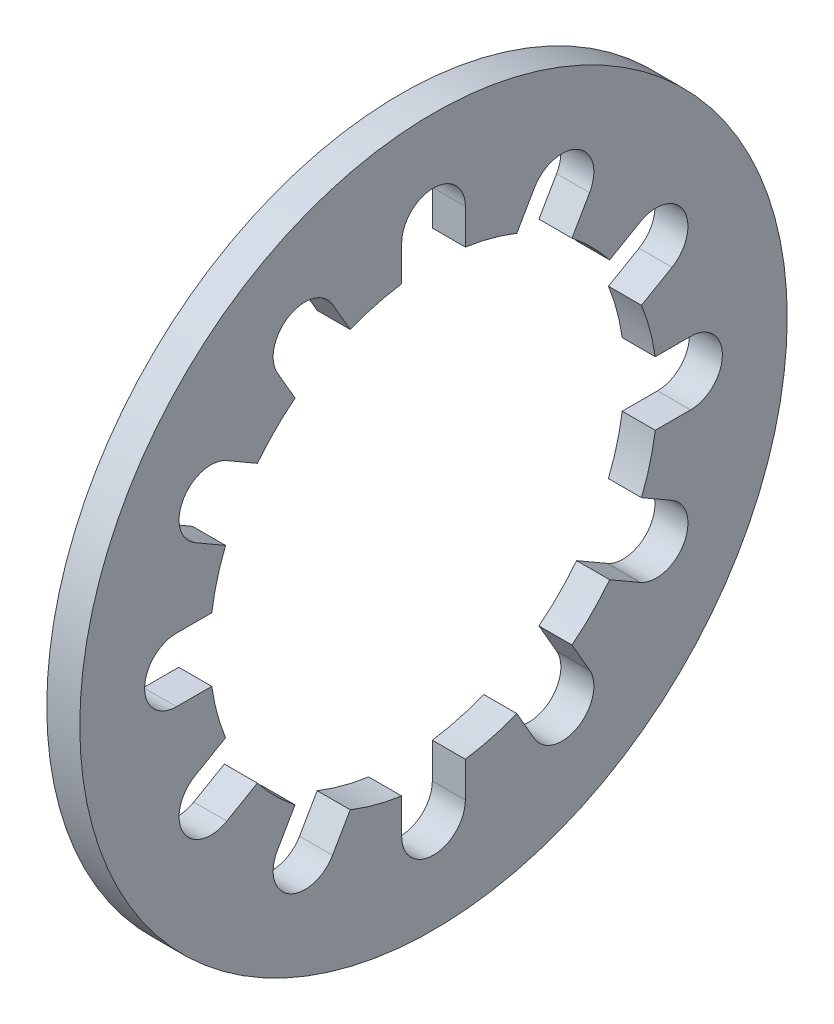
ISO-10303-21;
HEADER;
FILE_DESCRIPTION(('STEP AP214'),'2;1');
FILE_NAME('part.step','',(''),(''),'','','');
FILE_SCHEMA(('AUTOMOTIVE_DESIGN { 1 0 10303 214 1 1 1 1 }'));
ENDSEC;
DATA;
#1=APPLICATION_CONTEXT('core data for automotive mechanical design processes');
#2=APPLICATION_PROTOCOL_DEFINITION('international standard','automotive_design',2000,#1);
#3=PRODUCT_CONTEXT('',#1,'mechanical');
#4=PRODUCT('Part','Part','',(#3));
#5=PRODUCT_RELATED_PRODUCT_CATEGORY('part','',(#4));
#6=PRODUCT_DEFINITION_FORMATION('','',#4);
#7=PRODUCT_DEFINITION_CONTEXT('part definition',#1,'design');
#8=PRODUCT_DEFINITION('design','',#6,#7);
#9=PRODUCT_DEFINITION_SHAPE('','',#8);
#10=(LENGTH_UNIT() NAMED_UNIT(*) SI_UNIT(.MILLI.,.METRE.));
#11=(NAMED_UNIT(*) PLANE_ANGLE_UNIT() SI_UNIT($,.RADIAN.));
#12=(NAMED_UNIT(*) SI_UNIT($,.STERADIAN.) SOLID_ANGLE_UNIT());
#13=UNCERTAINTY_MEASURE_WITH_UNIT(LENGTH_MEASURE(1.E-05),#10,'distance_accuracy_value','');
#14=(GEOMETRIC_REPRESENTATION_CONTEXT(3) GLOBAL_UNCERTAINTY_ASSIGNED_CONTEXT((#13)) GLOBAL_UNIT_ASSIGNED_CONTEXT((#10,
#11,#12)) REPRESENTATION_CONTEXT('',''));
#15=CARTESIAN_POINT('',(0.,0.,0.));
#16=DIRECTION('',(0.,0.,1.));
#17=DIRECTION('',(1.,0.,0.));
#18=AXIS2_PLACEMENT_3D('',#15,#16,#17);
#19=CARTESIAN_POINT('',(-1.4,0.,0.));
#20=DIRECTION('',(1.,0.,0.));
#21=DIRECTION('',(0.,0.,-1.));
#22=AXIS2_PLACEMENT_3D('',#19,#20,#21);
#23=CYLINDRICAL_SURFACE('',#22,9.5);
#24=CARTESIAN_POINT('',(-1.4,0.,0.));
#25=DIRECTION('',(1.,0.,0.));
#26=DIRECTION('',(0.,0.,-1.));
#27=AXIS2_PLACEMENT_3D('',#24,#25,#26);
#28=CIRCLE('',#27,9.5);
#29=CARTESIAN_POINT('',(-1.4,7.46874760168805,5.87092916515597));
#30=VERTEX_POINT('',#29);
#31=CARTESIAN_POINT('',(-1.4,5.87092916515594,7.46874760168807));
#32=VERTEX_POINT('',#31);
#33=EDGE_CURVE('E598',#30,#32,#28,.T.);
#34=ORIENTED_EDGE('',*,*,#33,.F.);
#35=DIRECTION('',(1.,0.,0.));
#36=VECTOR('',#35,1.);
#37=CARTESIAN_POINT('',(-1.4,7.46874760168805,5.87092916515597));
#38=LINE('',#37,#36);
#39=CARTESIAN_POINT('',(0.,7.46874760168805,5.87092916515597));
#40=VERTEX_POINT('',#39);
#41=EDGE_CURVE('E11',#30,#40,#38,.T.);
#42=ORIENTED_EDGE('',*,*,#41,.T.);
#43=CARTESIAN_POINT('',(0.,0.,0.));
#44=DIRECTION('',(1.,0.,0.));
#45=DIRECTION('',(0.,0.,-1.));
#46=AXIS2_PLACEMENT_3D('',#43,#44,#45);
#47=CIRCLE('',#46,9.5);
#48=CARTESIAN_POINT('',(0.,5.87092916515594,7.46874760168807));
#49=VERTEX_POINT('',#48);
#50=EDGE_CURVE('E603',#40,#49,#47,.T.);
#51=ORIENTED_EDGE('',*,*,#50,.T.);
#52=DIRECTION('',(1.,0.,0.));
#53=VECTOR('',#52,1.);
#54=CARTESIAN_POINT('',(-1.4,5.87092916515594,7.46874760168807));
#55=LINE('',#54,#53);
#56=EDGE_CURVE('E667',#49,#32,#55,.F.);
#57=ORIENTED_EDGE('',*,*,#56,.T.);
#58=EDGE_LOOP('',(#34,#42,#51,#57));
#59=FACE_BOUND('',#58,.T.);
#60=ADVANCED_FACE('F31',(#59),#23,.F.);
#61=CARTESIAN_POINT('',(-1.4,3.53266057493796,8.81874760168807));
#62=VERTEX_POINT('',#61);
#63=CARTESIAN_POINT('',(-1.4,1.34999999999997,9.40358974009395));
#64=VERTEX_POINT('',#63);
#65=EDGE_CURVE('E701',#62,#64,#28,.T.);
#66=ORIENTED_EDGE('',*,*,#65,.F.);
#67=DIRECTION('',(1.,0.,0.));
#68=VECTOR('',#67,1.);
#69=CARTESIAN_POINT('',(-1.4,3.53266057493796,8.81874760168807));
#70=LINE('',#69,#68);
#71=CARTESIAN_POINT('',(0.,3.53266057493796,8.81874760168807));
#72=VERTEX_POINT('',#71);
#73=EDGE_CURVE('E670',#62,#72,#70,.T.);
#74=ORIENTED_EDGE('',*,*,#73,.T.);
#75=CARTESIAN_POINT('',(0.,1.34999999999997,9.40358974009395));
#76=VERTEX_POINT('',#75);
#77=EDGE_CURVE('E766',#72,#76,#47,.T.);
#78=ORIENTED_EDGE('',*,*,#77,.T.);
#79=DIRECTION('',(1.,0.,0.));
#80=VECTOR('',#79,1.);
#81=CARTESIAN_POINT('',(-1.4,1.34999999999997,9.40358974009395));
#82=LINE('',#81,#80);
#83=EDGE_CURVE('E661',#76,#64,#82,.F.);
#84=ORIENTED_EDGE('',*,*,#83,.T.);
#85=EDGE_LOOP('',(#66,#74,#78,#84));
#86=FACE_BOUND('',#85,.T.);
#87=ADVANCED_FACE('F782',(#86),#23,.F.);
#88=CARTESIAN_POINT('',(-1.4,-1.35000000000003,9.40358974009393));
#89=VERTEX_POINT('',#88);
#90=CARTESIAN_POINT('',(-1.4,-3.53266057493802,8.81874760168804));
#91=VERTEX_POINT('',#90);
#92=EDGE_CURVE('E703',#89,#91,#28,.T.);
#93=ORIENTED_EDGE('',*,*,#92,.F.);
#94=DIRECTION('',(1.,0.,0.));
#95=VECTOR('',#94,1.);
#96=CARTESIAN_POINT('',(-1.4,-1.35000000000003,9.40358974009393));
#97=LINE('',#96,#95);
#98=CARTESIAN_POINT('',(0.,-1.35000000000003,9.40358974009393));
#99=VERTEX_POINT('',#98);
#100=EDGE_CURVE('E664',#89,#99,#97,.T.);
#101=ORIENTED_EDGE('',*,*,#100,.T.);
#102=CARTESIAN_POINT('',(0.,-3.53266057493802,8.81874760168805));
#103=VERTEX_POINT('',#102);
#104=EDGE_CURVE('E762',#99,#103,#47,.T.);
#105=ORIENTED_EDGE('',*,*,#104,.T.);
#106=DIRECTION('',(1.,0.,0.));
#107=VECTOR('',#106,1.);
#108=CARTESIAN_POINT('',(-1.4,-3.53266057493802,8.81874760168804));
#109=LINE('',#108,#107);
#110=EDGE_CURVE('E655',#103,#91,#109,.F.);
#111=ORIENTED_EDGE('',*,*,#110,.T.);
#112=EDGE_LOOP('',(#93,#101,#105,#111));
#113=FACE_BOUND('',#112,.T.);
#114=ADVANCED_FACE('F793',(#113),#23,.F.);
#115=CARTESIAN_POINT('',(-1.4,-5.870929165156,7.46874760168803));
#116=VERTEX_POINT('',#115);
#117=CARTESIAN_POINT('',(-1.4,-7.46874760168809,5.87092916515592));
#118=VERTEX_POINT('',#117);
#119=EDGE_CURVE('E706',#116,#118,#28,.T.);
#120=ORIENTED_EDGE('',*,*,#119,.F.);
#121=DIRECTION('',(1.,0.,0.));
#122=VECTOR('',#121,1.);
#123=CARTESIAN_POINT('',(-1.4,-5.870929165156,7.46874760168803));
#124=LINE('',#123,#122);
#125=CARTESIAN_POINT('',(0.,-5.870929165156,7.46874760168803));
#126=VERTEX_POINT('',#125);
#127=EDGE_CURVE('E658',#116,#126,#124,.T.);
#128=ORIENTED_EDGE('',*,*,#127,.T.);
#129=CARTESIAN_POINT('',(0.,-7.46874760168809,5.87092916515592));
#130=VERTEX_POINT('',#129);
#131=EDGE_CURVE('E758',#126,#130,#47,.T.);
#132=ORIENTED_EDGE('',*,*,#131,.T.);
#133=DIRECTION('',(1.,0.,0.));
#134=VECTOR('',#133,1.);
#135=CARTESIAN_POINT('',(-1.4,-7.46874760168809,5.87092916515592));
#136=LINE('',#135,#134);
#137=EDGE_CURVE('E652',#130,#118,#136,.F.);
#138=ORIENTED_EDGE('',*,*,#137,.T.);
#139=EDGE_LOOP('',(#120,#128,#132,#138));
#140=FACE_BOUND('',#139,.T.);
#141=ADVANCED_FACE('F804',(#140),#23,.F.);
#142=CARTESIAN_POINT('',(0.,9.40358974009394,1.35));
#143=VERTEX_POINT('',#142);
#144=CARTESIAN_POINT('',(0.,8.81874760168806,3.53266057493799));
#145=VERTEX_POINT('',#144);
#146=EDGE_CURVE('E600',#143,#145,#47,.T.);
#147=ORIENTED_EDGE('',*,*,#146,.T.);
#148=DIRECTION('',(1.,0.,0.));
#149=VECTOR('',#148,1.);
#150=CARTESIAN_POINT('',(-1.4,8.81874760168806,3.53266057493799));
#151=LINE('',#150,#149);
#152=CARTESIAN_POINT('',(-1.4,8.81874760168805,3.53266057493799));
#153=VERTEX_POINT('',#152);
#154=EDGE_CURVE('E39',#145,#153,#151,.F.);
#155=ORIENTED_EDGE('',*,*,#154,.T.);
#156=CARTESIAN_POINT('',(-1.4,9.40358974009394,1.35));
#157=VERTEX_POINT('',#156);
#158=EDGE_CURVE('E594',#157,#153,#28,.T.);
#159=ORIENTED_EDGE('',*,*,#158,.F.);
#160=DIRECTION('',(1.,0.,0.));
#161=VECTOR('',#160,1.);
#162=CARTESIAN_POINT('',(-1.4,9.40358974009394,1.35));
#163=LINE('',#162,#161);
#164=EDGE_CURVE('E612',#157,#143,#163,.T.);
#165=ORIENTED_EDGE('',*,*,#164,.T.);
#166=EDGE_LOOP('',(#147,#155,#159,#165));
#167=FACE_BOUND('',#166,.T.);
#168=ADVANCED_FACE('F675',(#167),#23,.F.);
#169=CARTESIAN_POINT('',(-1.4,-9.40358974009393,-1.35000000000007));
#170=VERTEX_POINT('',#169);
#171=CARTESIAN_POINT('',(-1.4,-8.81874760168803,-3.53266057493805));
#172=VERTEX_POINT('',#171);
#173=EDGE_CURVE('E713',#170,#172,#28,.T.);
#174=ORIENTED_EDGE('',*,*,#173,.F.);
#175=DIRECTION('',(1.,0.,0.));
#176=VECTOR('',#175,1.);
#177=CARTESIAN_POINT('',(-1.4,-9.40358974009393,-1.35000000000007));
#178=LINE('',#177,#176);
#179=CARTESIAN_POINT('',(0.,-9.40358974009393,-1.35000000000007));
#180=VERTEX_POINT('',#179);
#181=EDGE_CURVE('E644',#170,#180,#178,.T.);
#182=ORIENTED_EDGE('',*,*,#181,.T.);
#183=CARTESIAN_POINT('',(0.,-8.81874760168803,-3.53266057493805));
#184=VERTEX_POINT('',#183);
#185=EDGE_CURVE('E750',#180,#184,#47,.T.);
#186=ORIENTED_EDGE('',*,*,#185,.T.);
#187=DIRECTION('',(1.,0.,0.));
#188=VECTOR('',#187,1.);
#189=CARTESIAN_POINT('',(-1.4,-8.81874760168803,-3.53266057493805));
#190=LINE('',#189,#188);
#191=EDGE_CURVE('E635',#184,#172,#190,.F.);
#192=ORIENTED_EDGE('',*,*,#191,.T.);
#193=EDGE_LOOP('',(#174,#182,#186,#192));
#194=FACE_BOUND('',#193,.T.);
#195=ADVANCED_FACE('F824',(#194),#23,.F.);
#196=CARTESIAN_POINT('',(-1.4,-7.46874760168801,-5.87092916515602));
#197=VERTEX_POINT('',#196);
#198=CARTESIAN_POINT('',(-1.4,-5.87092916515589,-7.46874760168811));
#199=VERTEX_POINT('',#198);
#200=EDGE_CURVE('E716',#197,#199,#28,.T.);
#201=ORIENTED_EDGE('',*,*,#200,.F.);
#202=DIRECTION('',(1.,0.,0.));
#203=VECTOR('',#202,1.);
#204=CARTESIAN_POINT('',(-1.4,-7.46874760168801,-5.87092916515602));
#205=LINE('',#204,#203);
#206=CARTESIAN_POINT('',(0.,-7.46874760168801,-5.87092916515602));
#207=VERTEX_POINT('',#206);
#208=EDGE_CURVE('E638',#197,#207,#205,.T.);
#209=ORIENTED_EDGE('',*,*,#208,.T.);
#210=CARTESIAN_POINT('',(0.,-5.87092916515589,-7.46874760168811));
#211=VERTEX_POINT('',#210);
#212=EDGE_CURVE('E746',#207,#211,#47,.T.);
#213=ORIENTED_EDGE('',*,*,#212,.T.);
#214=DIRECTION('',(1.,0.,0.));
#215=VECTOR('',#214,1.);
#216=CARTESIAN_POINT('',(-1.4,-5.87092916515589,-7.46874760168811));
#217=LINE('',#216,#215);
#218=EDGE_CURVE('E629',#211,#199,#217,.F.);
#219=ORIENTED_EDGE('',*,*,#218,.T.);
#220=EDGE_LOOP('',(#201,#209,#213,#219));
#221=FACE_BOUND('',#220,.T.);
#222=ADVANCED_FACE('F835',(#221),#23,.F.);
#223=CARTESIAN_POINT('',(-1.4,-3.5326605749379,-8.81874760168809));
#224=VERTEX_POINT('',#223);
#225=CARTESIAN_POINT('',(-1.4,-1.3499999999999,-9.40358974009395));
#226=VERTEX_POINT('',#225);
#227=EDGE_CURVE('E719',#224,#226,#28,.T.);
#228=ORIENTED_EDGE('',*,*,#227,.F.);
#229=DIRECTION('',(1.,0.,0.));
#230=VECTOR('',#229,1.);
#231=CARTESIAN_POINT('',(-1.4,-3.5326605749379,-8.81874760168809));
#232=LINE('',#231,#230);
#233=CARTESIAN_POINT('',(0.,-3.5326605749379,-8.81874760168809));
#234=VERTEX_POINT('',#233);
#235=EDGE_CURVE('E632',#224,#234,#232,.T.);
#236=ORIENTED_EDGE('',*,*,#235,.T.);
#237=CARTESIAN_POINT('',(0.,-1.3499999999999,-9.40358974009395));
#238=VERTEX_POINT('',#237);
#239=EDGE_CURVE('E742',#234,#238,#47,.T.);
#240=ORIENTED_EDGE('',*,*,#239,.T.);
#241=DIRECTION('',(1.,0.,0.));
#242=VECTOR('',#241,1.);
#243=CARTESIAN_POINT('',(-1.4,-1.3499999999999,-9.40358974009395));
#244=LINE('',#243,#242);
#245=EDGE_CURVE('E623',#238,#226,#244,.F.);
#246=ORIENTED_EDGE('',*,*,#245,.T.);
#247=EDGE_LOOP('',(#228,#236,#240,#246));
#248=FACE_BOUND('',#247,.T.);
#249=ADVANCED_FACE('F846',(#248),#23,.F.);
#250=CARTESIAN_POINT('',(-1.4,1.3500000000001,-9.40358974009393));
#251=VERTEX_POINT('',#250);
#252=CARTESIAN_POINT('',(-1.4,3.53266057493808,-8.81874760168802));
#253=VERTEX_POINT('',#252);
#254=EDGE_CURVE('E722',#251,#253,#28,.T.);
#255=ORIENTED_EDGE('',*,*,#254,.F.);
#256=DIRECTION('',(1.,0.,0.));
#257=VECTOR('',#256,1.);
#258=CARTESIAN_POINT('',(-1.4,1.3500000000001,-9.40358974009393));
#259=LINE('',#258,#257);
#260=CARTESIAN_POINT('',(0.,1.3500000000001,-9.40358974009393));
#261=VERTEX_POINT('',#260);
#262=EDGE_CURVE('E626',#251,#261,#259,.T.);
#263=ORIENTED_EDGE('',*,*,#262,.T.);
#264=CARTESIAN_POINT('',(0.,3.53266057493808,-8.81874760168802));
#265=VERTEX_POINT('',#264);
#266=EDGE_CURVE('E738',#261,#265,#47,.T.);
#267=ORIENTED_EDGE('',*,*,#266,.T.);
#268=DIRECTION('',(1.,0.,0.));
#269=VECTOR('',#268,1.);
#270=CARTESIAN_POINT('',(-1.4,3.53266057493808,-8.81874760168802));
#271=LINE('',#270,#269);
#272=EDGE_CURVE('E617',#265,#253,#271,.F.);
#273=ORIENTED_EDGE('',*,*,#272,.T.);
#274=EDGE_LOOP('',(#255,#263,#267,#273));
#275=FACE_BOUND('',#274,.T.);
#276=ADVANCED_FACE('F857',(#275),#23,.F.);
#277=CARTESIAN_POINT('',(-1.4,5.87092916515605,-7.46874760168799));
#278=VERTEX_POINT('',#277);
#279=CARTESIAN_POINT('',(-1.4,7.46874760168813,-5.87092916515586));
#280=VERTEX_POINT('',#279);
#281=EDGE_CURVE('E357',#278,#280,#28,.T.);
#282=ORIENTED_EDGE('',*,*,#281,.F.);
#283=DIRECTION('',(1.,0.,0.));
#284=VECTOR('',#283,1.);
#285=CARTESIAN_POINT('',(-1.4,5.87092916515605,-7.46874760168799));
#286=LINE('',#285,#284);
#287=CARTESIAN_POINT('',(0.,5.87092916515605,-7.46874760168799));
#288=VERTEX_POINT('',#287);
#289=EDGE_CURVE('E620',#278,#288,#286,.T.);
#290=ORIENTED_EDGE('',*,*,#289,.T.);
#291=CARTESIAN_POINT('',(0.,7.46874760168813,-5.87092916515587));
#292=VERTEX_POINT('',#291);
#293=EDGE_CURVE('E736',#288,#292,#47,.T.);
#294=ORIENTED_EDGE('',*,*,#293,.T.);
#295=DIRECTION('',(1.,0.,0.));
#296=VECTOR('',#295,1.);
#297=CARTESIAN_POINT('',(-1.4,7.46874760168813,-5.87092916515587));
#298=LINE('',#297,#296);
#299=EDGE_CURVE('E615',#292,#280,#298,.F.);
#300=ORIENTED_EDGE('',*,*,#299,.T.);
#301=EDGE_LOOP('',(#282,#290,#294,#300));
#302=FACE_BOUND('',#301,.T.);
#303=ADVANCED_FACE('F868',(#302),#23,.F.);
#304=CARTESIAN_POINT('',(-1.4,8.81874760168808,-3.53266057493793));
#305=VERTEX_POINT('',#304);
#306=CARTESIAN_POINT('',(-1.4,9.40358974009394,-1.35));
#307=VERTEX_POINT('',#306);
#308=EDGE_CURVE('E599',#305,#307,#28,.T.);
#309=ORIENTED_EDGE('',*,*,#308,.F.);
#310=DIRECTION('',(1.,0.,0.));
#311=VECTOR('',#310,1.);
#312=CARTESIAN_POINT('',(-1.4,8.81874760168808,-3.53266057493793));
#313=LINE('',#312,#311);
#314=CARTESIAN_POINT('',(0.,8.81874760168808,-3.53266057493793));
#315=VERTEX_POINT('',#314);
#316=EDGE_CURVE('E647',#305,#315,#313,.T.);
#317=ORIENTED_EDGE('',*,*,#316,.T.);
#318=CARTESIAN_POINT('',(0.,9.40358974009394,-1.35));
#319=VERTEX_POINT('',#318);
#320=EDGE_CURVE('E591',#315,#319,#47,.T.);
#321=ORIENTED_EDGE('',*,*,#320,.T.);
#322=DIRECTION('',(1.,0.,0.));
#323=VECTOR('',#322,1.);
#324=CARTESIAN_POINT('',(-1.4,9.40358974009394,-1.35));
#325=LINE('',#324,#323);
#326=EDGE_CURVE('E607',#319,#307,#325,.F.);
#327=ORIENTED_EDGE('',*,*,#326,.T.);
#328=EDGE_LOOP('',(#309,#317,#321,#327));
#329=FACE_BOUND('',#328,.T.);
#330=ADVANCED_FACE('F733',(#329),#23,.F.);
#331=CARTESIAN_POINT('',(-1.4,0.,0.));
#332=DIRECTION('',(1.,0.,0.));
#333=DIRECTION('',(0.,0.,-1.));
#334=AXIS2_PLACEMENT_3D('',#331,#332,#333);
#335=CYLINDRICAL_SURFACE('',#334,15.);
#336=CARTESIAN_POINT('',(-1.4,0.,0.));
#337=DIRECTION('',(1.,0.,0.));
#338=DIRECTION('',(0.,0.,-1.));
#339=AXIS2_PLACEMENT_3D('',#336,#337,#338);
#340=CIRCLE('',#339,15.);
#341=CARTESIAN_POINT('',(-1.4,0.,-15.));
#342=VERTEX_POINT('',#341);
#343=EDGE_CURVE('E604',#342,#342,#340,.T.);
#344=ORIENTED_EDGE('',*,*,#343,.T.);
#345=EDGE_LOOP('',(#344));
#346=FACE_BOUND('',#345,.T.);
#347=CARTESIAN_POINT('',(0.,0.,0.));
#348=DIRECTION('',(1.,0.,0.));
#349=DIRECTION('',(0.,0.,-1.));
#350=AXIS2_PLACEMENT_3D('',#347,#348,#349);
#351=CIRCLE('',#350,15.);
#352=CARTESIAN_POINT('',(0.,0.,-15.));
#353=VERTEX_POINT('',#352);
#354=EDGE_CURVE('E597',#353,#353,#351,.T.);
#355=ORIENTED_EDGE('',*,*,#354,.F.);
#356=EDGE_LOOP('',(#355));
#357=FACE_BOUND('',#356,.T.);
#358=ADVANCED_FACE('F33',(#346,#357),#335,.T.);
#359=CARTESIAN_POINT('',(-1.4,0.,0.));
#360=DIRECTION('',(1.,0.,0.));
#361=DIRECTION('',(0.,0.,-1.));
#362=AXIS2_PLACEMENT_3D('',#359,#360,#361);
#363=PLANE('',#362);
#364=CARTESIAN_POINT('',(-1.4,9.43967690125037,5.45000000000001));
#365=DIRECTION('',(1.,0.,0.));
#366=DIRECTION('',(0.,0.500000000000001,-0.866025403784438));
#367=AXIS2_PLACEMENT_3D('',#364,#365,#366);
#368=CIRCLE('',#367,1.35);
#369=CARTESIAN_POINT('',(-1.4,10.1146769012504,4.28086570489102));
#370=VERTEX_POINT('',#369);
#371=CARTESIAN_POINT('',(-1.4,8.76467690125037,6.619134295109));
#372=VERTEX_POINT('',#371);
#373=EDGE_CURVE('E556',#370,#372,#368,.T.);
#374=ORIENTED_EDGE('',*,*,#373,.T.);
#375=DIRECTION('',(0.,-0.866025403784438,-0.500000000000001));
#376=VECTOR('',#375,1.);
#377=CARTESIAN_POINT('',(-1.4,8.76467690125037,6.619134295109));
#378=LINE('',#377,#376);
#379=EDGE_CURVE('E559',#372,#30,#378,.T.);
#380=ORIENTED_EDGE('',*,*,#379,.T.);
#381=ORIENTED_EDGE('',*,*,#33,.T.);
#382=DIRECTION('',(0.,0.499999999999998,0.86602540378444));
#383=VECTOR('',#382,1.);
#384=CARTESIAN_POINT('',(-1.4,1.16913429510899,-0.674999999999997));
#385=LINE('',#384,#383);
#386=CARTESIAN_POINT('',(-1.4,6.61913429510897,8.7646769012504));
#387=VERTEX_POINT('',#386);
#388=EDGE_CURVE('E532',#32,#387,#385,.T.);
#389=ORIENTED_EDGE('',*,*,#388,.T.);
#390=CARTESIAN_POINT('',(-1.4,5.44999999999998,9.4396769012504));
#391=DIRECTION('',(1.,0.,0.));
#392=DIRECTION('',(0.,0.86602540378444,-0.499999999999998));
#393=AXIS2_PLACEMENT_3D('',#390,#391,#392);
#394=CIRCLE('',#393,1.35);
#395=CARTESIAN_POINT('',(-1.4,4.28086570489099,10.1146769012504));
#396=VERTEX_POINT('',#395);
#397=EDGE_CURVE('E535',#387,#396,#394,.T.);
#398=ORIENTED_EDGE('',*,*,#397,.T.);
#399=DIRECTION('',(0.,-0.499999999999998,-0.86602540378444));
#400=VECTOR('',#399,1.);
#401=CARTESIAN_POINT('',(-1.4,4.28086570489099,10.1146769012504));
#402=LINE('',#401,#400);
#403=EDGE_CURVE('E539',#396,#62,#402,.T.);
#404=ORIENTED_EDGE('',*,*,#403,.T.);
#405=ORIENTED_EDGE('',*,*,#65,.T.);
#406=DIRECTION('',(0.,0.,1.));
#407=VECTOR('',#406,1.);
#408=CARTESIAN_POINT('',(-1.4,1.35,0.));
#409=LINE('',#408,#407);
#410=CARTESIAN_POINT('',(-1.4,1.34999999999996,10.9));
#411=VERTEX_POINT('',#410);
#412=EDGE_CURVE('E511',#64,#411,#409,.T.);
#413=ORIENTED_EDGE('',*,*,#412,.T.);
#414=CARTESIAN_POINT('',(-1.4,0.,10.9));
#415=DIRECTION('',(1.,0.,0.));
#416=DIRECTION('',(0.,1.,0.));
#417=AXIS2_PLACEMENT_3D('',#414,#415,#416);
#418=CIRCLE('',#417,1.35);
#419=CARTESIAN_POINT('',(-1.4,-1.35000000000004,10.9));
#420=VERTEX_POINT('',#419);
#421=EDGE_CURVE('E514',#411,#420,#418,.T.);
#422=ORIENTED_EDGE('',*,*,#421,.T.);
#423=DIRECTION('',(0.,0.,-1.));
#424=VECTOR('',#423,1.);
#425=CARTESIAN_POINT('',(-1.4,-1.35000000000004,10.9));
#426=LINE('',#425,#424);
#427=EDGE_CURVE('E518',#420,#89,#426,.T.);
#428=ORIENTED_EDGE('',*,*,#427,.T.);
#429=ORIENTED_EDGE('',*,*,#92,.T.);
#430=DIRECTION('',(0.,-0.500000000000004,0.866025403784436));
#431=VECTOR('',#430,1.);
#432=CARTESIAN_POINT('',(-1.4,1.16913429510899,0.675000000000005));
#433=LINE('',#432,#431);
#434=CARTESIAN_POINT('',(-1.4,-4.28086570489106,10.1146769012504));
#435=VERTEX_POINT('',#434);
#436=EDGE_CURVE('E490',#91,#435,#433,.T.);
#437=ORIENTED_EDGE('',*,*,#436,.T.);
#438=CARTESIAN_POINT('',(-1.4,-5.45000000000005,9.43967690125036));
#439=DIRECTION('',(1.,0.,0.));
#440=DIRECTION('',(0.,0.866025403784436,0.500000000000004));
#441=AXIS2_PLACEMENT_3D('',#438,#439,#440);
#442=CIRCLE('',#441,1.35);
#443=CARTESIAN_POINT('',(-1.4,-6.61913429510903,8.76467690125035));
#444=VERTEX_POINT('',#443);
#445=EDGE_CURVE('E493',#435,#444,#442,.T.);
#446=ORIENTED_EDGE('',*,*,#445,.T.);
#447=DIRECTION('',(0.,0.500000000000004,-0.866025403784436));
#448=VECTOR('',#447,1.);
#449=CARTESIAN_POINT('',(-1.4,-6.61913429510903,8.76467690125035));
#450=LINE('',#449,#448);
#451=EDGE_CURVE('E497',#444,#116,#450,.T.);
#452=ORIENTED_EDGE('',*,*,#451,.T.);
#453=ORIENTED_EDGE('',*,*,#119,.T.);
#454=DIRECTION('',(0.,-0.866025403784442,0.499999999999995));
#455=VECTOR('',#454,1.);
#456=CARTESIAN_POINT('',(-1.4,0.674999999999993,1.169134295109));
#457=LINE('',#456,#455);
#458=CARTESIAN_POINT('',(-1.4,-8.76467690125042,6.61913429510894));
#459=VERTEX_POINT('',#458);
#460=EDGE_CURVE('E472',#118,#459,#457,.T.);
#461=ORIENTED_EDGE('',*,*,#460,.T.);
#462=CARTESIAN_POINT('',(-1.4,-9.43967690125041,5.44999999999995));
#463=DIRECTION('',(1.,0.,0.));
#464=DIRECTION('',(0.,0.499999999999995,0.866025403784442));
#465=AXIS2_PLACEMENT_3D('',#462,#463,#464);
#466=CIRCLE('',#465,1.35);
#467=CARTESIAN_POINT('',(-1.4,-10.1146769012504,4.28086570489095));
#468=VERTEX_POINT('',#467);
#469=EDGE_CURVE('E471',#459,#468,#466,.T.);
#470=ORIENTED_EDGE('',*,*,#469,.T.);
#471=DIRECTION('',(0.,0.866025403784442,-0.499999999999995));
#472=VECTOR('',#471,1.);
#473=CARTESIAN_POINT('',(-1.4,-10.1146769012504,4.28086570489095));
#474=LINE('',#473,#472);
#475=CARTESIAN_POINT('',(-1.4,-8.81874760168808,3.53266057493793));
#476=VERTEX_POINT('',#475);
#477=EDGE_CURVE('E475',#468,#476,#474,.T.);
#478=ORIENTED_EDGE('',*,*,#477,.T.);
#479=CARTESIAN_POINT('',(-1.4,-9.40358974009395,1.34999999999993));
#480=VERTEX_POINT('',#479);
#481=EDGE_CURVE('E709',#476,#480,#28,.T.);
#482=ORIENTED_EDGE('',*,*,#481,.T.);
#483=DIRECTION('',(0.,-1.,0.));
#484=VECTOR('',#483,1.);
#485=CARTESIAN_POINT('',(-1.4,0.,1.35));
#486=LINE('',#485,#484);
#487=CARTESIAN_POINT('',(-1.4,-10.9,1.34999999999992));
#488=VERTEX_POINT('',#487);
#489=EDGE_CURVE('E448',#480,#488,#486,.T.);
#490=ORIENTED_EDGE('',*,*,#489,.T.);
#491=CARTESIAN_POINT('',(-1.4,-10.9,0.));
#492=DIRECTION('',(1.,0.,0.));
#493=DIRECTION('',(0.,0.,1.));
#494=AXIS2_PLACEMENT_3D('',#491,#492,#493);
#495=CIRCLE('',#494,1.35);
#496=CARTESIAN_POINT('',(-1.4,-10.9,-1.35000000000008));
#497=VERTEX_POINT('',#496);
#498=EDGE_CURVE('E451',#488,#497,#495,.T.);
#499=ORIENTED_EDGE('',*,*,#498,.T.);
#500=DIRECTION('',(0.,1.,0.));
#501=VECTOR('',#500,1.);
#502=CARTESIAN_POINT('',(-1.4,-10.9,-1.35000000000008));
#503=LINE('',#502,#501);
#504=EDGE_CURVE('E455',#497,#170,#503,.T.);
#505=ORIENTED_EDGE('',*,*,#504,.T.);
#506=ORIENTED_EDGE('',*,*,#173,.T.);
#507=DIRECTION('',(0.,-0.866025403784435,-0.500000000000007));
#508=VECTOR('',#507,1.);
#509=CARTESIAN_POINT('',(-1.4,-0.675000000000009,1.16913429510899));
#510=LINE('',#509,#508);
#511=CARTESIAN_POINT('',(-1.4,-10.1146769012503,-4.28086570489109));
#512=VERTEX_POINT('',#511);
#513=EDGE_CURVE('E427',#172,#512,#510,.T.);
#514=ORIENTED_EDGE('',*,*,#513,.T.);
#515=CARTESIAN_POINT('',(-1.4,-9.43967690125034,-5.45000000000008));
#516=DIRECTION('',(1.,0.,0.));
#517=DIRECTION('',(0.,-0.500000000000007,0.866025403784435));
#518=AXIS2_PLACEMENT_3D('',#515,#516,#517);
#519=CIRCLE('',#518,1.35);
#520=CARTESIAN_POINT('',(-1.4,-8.76467690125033,-6.61913429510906));
#521=VERTEX_POINT('',#520);
#522=EDGE_CURVE('E430',#512,#521,#519,.T.);
#523=ORIENTED_EDGE('',*,*,#522,.T.);
#524=DIRECTION('',(0.,0.866025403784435,0.500000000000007));
#525=VECTOR('',#524,1.);
#526=CARTESIAN_POINT('',(-1.4,-8.76467690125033,-6.61913429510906));
#527=LINE('',#526,#525);
#528=EDGE_CURVE('E434',#521,#197,#527,.T.);
#529=ORIENTED_EDGE('',*,*,#528,.T.);
#530=ORIENTED_EDGE('',*,*,#200,.T.);
#531=DIRECTION('',(0.,-0.499999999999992,-0.866025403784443));
#532=VECTOR('',#531,1.);
#533=CARTESIAN_POINT('',(-1.4,-1.169134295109,0.674999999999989));
#534=LINE('',#533,#532);
#535=CARTESIAN_POINT('',(-1.4,-6.61913429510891,-8.76467690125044));
#536=VERTEX_POINT('',#535);
#537=EDGE_CURVE('E406',#199,#536,#534,.T.);
#538=ORIENTED_EDGE('',*,*,#537,.T.);
#539=CARTESIAN_POINT('',(-1.4,-5.44999999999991,-9.43967690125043));
#540=DIRECTION('',(1.,0.,0.));
#541=DIRECTION('',(0.,-0.866025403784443,0.499999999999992));
#542=AXIS2_PLACEMENT_3D('',#539,#540,#541);
#543=CIRCLE('',#542,1.35);
#544=CARTESIAN_POINT('',(-1.4,-4.28086570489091,-10.1146769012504));
#545=VERTEX_POINT('',#544);
#546=EDGE_CURVE('E409',#536,#545,#543,.T.);
#547=ORIENTED_EDGE('',*,*,#546,.T.);
#548=DIRECTION('',(0.,0.499999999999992,0.866025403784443));
#549=VECTOR('',#548,1.);
#550=CARTESIAN_POINT('',(-1.4,-4.28086570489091,-10.1146769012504));
#551=LINE('',#550,#549);
#552=EDGE_CURVE('E413',#545,#224,#551,.T.);
#553=ORIENTED_EDGE('',*,*,#552,.T.);
#554=ORIENTED_EDGE('',*,*,#227,.T.);
#555=DIRECTION('',(0.,0.,-1.));
#556=VECTOR('',#555,1.);
#557=CARTESIAN_POINT('',(-1.4,-1.35,0.));
#558=LINE('',#557,#556);
#559=CARTESIAN_POINT('',(-1.4,-1.34999999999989,-10.9));
#560=VERTEX_POINT('',#559);
#561=EDGE_CURVE('E385',#226,#560,#558,.T.);
#562=ORIENTED_EDGE('',*,*,#561,.T.);
#563=CARTESIAN_POINT('',(-1.4,1.14171505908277E-13,-10.9));
#564=DIRECTION('',(1.,0.,0.));
#565=DIRECTION('',(0.,-1.,0.));
#566=AXIS2_PLACEMENT_3D('',#563,#564,#565);
#567=CIRCLE('',#566,1.35);
#568=CARTESIAN_POINT('',(-1.4,1.35000000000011,-10.9));
#569=VERTEX_POINT('',#568);
#570=EDGE_CURVE('E388',#560,#569,#567,.T.);
#571=ORIENTED_EDGE('',*,*,#570,.T.);
#572=DIRECTION('',(0.,0.,1.));
#573=VECTOR('',#572,1.);
#574=CARTESIAN_POINT('',(-1.4,1.35000000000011,-10.9));
#575=LINE('',#574,#573);
#576=EDGE_CURVE('E392',#569,#251,#575,.T.);
#577=ORIENTED_EDGE('',*,*,#576,.T.);
#578=ORIENTED_EDGE('',*,*,#254,.T.);
#579=DIRECTION('',(0.,0.50000000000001,-0.866025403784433));
#580=VECTOR('',#579,1.);
#581=CARTESIAN_POINT('',(-1.4,-1.16913429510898,-0.675000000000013));
#582=LINE('',#581,#580);
#583=CARTESIAN_POINT('',(-1.4,4.28086570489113,-10.1146769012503));
#584=VERTEX_POINT('',#583);
#585=EDGE_CURVE('E365',#253,#584,#582,.T.);
#586=ORIENTED_EDGE('',*,*,#585,.T.);
#587=CARTESIAN_POINT('',(-1.4,5.45000000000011,-9.43967690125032));
#588=DIRECTION('',(1.,0.,0.));
#589=DIRECTION('',(0.,-0.866025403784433,-0.50000000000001));
#590=AXIS2_PLACEMENT_3D('',#587,#588,#589);
#591=CIRCLE('',#590,1.35);
#592=CARTESIAN_POINT('',(-1.4,6.61913429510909,-8.7646769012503));
#593=VERTEX_POINT('',#592);
#594=EDGE_CURVE('E368',#584,#593,#591,.T.);
#595=ORIENTED_EDGE('',*,*,#594,.T.);
#596=DIRECTION('',(0.,-0.50000000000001,0.866025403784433));
#597=VECTOR('',#596,1.);
#598=CARTESIAN_POINT('',(-1.4,6.61913429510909,-8.7646769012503));
#599=LINE('',#598,#597);
#600=EDGE_CURVE('E372',#593,#278,#599,.T.);
#601=ORIENTED_EDGE('',*,*,#600,.T.);
#602=ORIENTED_EDGE('',*,*,#281,.T.);
#603=DIRECTION('',(0.,0.866025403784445,-0.499999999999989));
#604=VECTOR('',#603,1.);
#605=CARTESIAN_POINT('',(-1.4,-0.674999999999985,-1.169134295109));
#606=LINE('',#605,#604);
#607=CARTESIAN_POINT('',(-1.4,8.76467690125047,-6.61913429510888));
#608=VERTEX_POINT('',#607);
#609=EDGE_CURVE('E54',#280,#608,#606,.T.);
#610=ORIENTED_EDGE('',*,*,#609,.T.);
#611=CARTESIAN_POINT('',(-1.4,9.43967690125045,-5.44999999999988));
#612=DIRECTION('',(1.,0.,0.));
#613=DIRECTION('',(0.,-0.499999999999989,-0.866025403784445));
#614=AXIS2_PLACEMENT_3D('',#611,#612,#613);
#615=CIRCLE('',#614,1.35);
#616=CARTESIAN_POINT('',(-1.4,10.1146769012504,-4.28086570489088));
#617=VERTEX_POINT('',#616);
#618=EDGE_CURVE('E343',#608,#617,#615,.T.);
#619=ORIENTED_EDGE('',*,*,#618,.T.);
#620=EDGE_CURVE('E469',#617,#305,#457,.T.);
#621=ORIENTED_EDGE('',*,*,#620,.T.);
#622=ORIENTED_EDGE('',*,*,#308,.T.);
#623=DIRECTION('',(0.,1.,0.));
#624=VECTOR('',#623,1.);
#625=CARTESIAN_POINT('',(-1.4,0.,-1.35));
#626=LINE('',#625,#624);
#627=CARTESIAN_POINT('',(-1.4,10.9,-1.35));
#628=VERTEX_POINT('',#627);
#629=EDGE_CURVE('E573',#307,#628,#626,.T.);
#630=ORIENTED_EDGE('',*,*,#629,.T.);
#631=CARTESIAN_POINT('',(-1.4,10.9,0.));
#632=DIRECTION('',(1.,0.,0.));
#633=DIRECTION('',(0.,0.,-1.));
#634=AXIS2_PLACEMENT_3D('',#631,#632,#633);
#635=CIRCLE('',#634,1.35);
#636=CARTESIAN_POINT('',(-1.4,10.9,1.35));
#637=VERTEX_POINT('',#636);
#638=EDGE_CURVE('E576',#628,#637,#635,.T.);
#639=ORIENTED_EDGE('',*,*,#638,.T.);
#640=DIRECTION('',(0.,-1.,0.));
#641=VECTOR('',#640,1.);
#642=CARTESIAN_POINT('',(-1.4,10.9,1.35));
#643=LINE('',#642,#641);
#644=EDGE_CURVE('E580',#637,#157,#643,.T.);
#645=ORIENTED_EDGE('',*,*,#644,.T.);
#646=ORIENTED_EDGE('',*,*,#158,.T.);
#647=DIRECTION('',(0.,0.866025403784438,0.500000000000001));
#648=VECTOR('',#647,1.);
#649=CARTESIAN_POINT('',(-1.4,0.675000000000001,-1.16913429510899));
#650=LINE('',#649,#648);
#651=EDGE_CURVE('E553',#153,#370,#650,.T.);
#652=ORIENTED_EDGE('',*,*,#651,.T.);
#653=EDGE_LOOP('',(#374,#380,#381,#389,#398,#404,#405,#413,#422,#428,#429,#437,#446,#452,#453,
#461,#470,#478,#482,#490,#499,#505,#506,#514,#523,#529,#530,#538,#547,#553,#554,#562,#571,#577,
#578,#586,#595,#601,#602,#610,#619,#621,#622,#630,#639,#645,#646,#652));
#654=FACE_BOUND('',#653,.T.);
#655=ORIENTED_EDGE('',*,*,#343,.F.);
#656=EDGE_LOOP('',(#655));
#657=FACE_BOUND('',#656,.T.);
#658=ADVANCED_FACE('F353',(#654,#657),#363,.F.);
#659=CARTESIAN_POINT('',(0.,0.,0.));
#660=DIRECTION('',(1.,0.,0.));
#661=DIRECTION('',(0.,0.,-1.));
#662=AXIS2_PLACEMENT_3D('',#659,#660,#661);
#663=PLANE('',#662);
#664=DIRECTION('',(0.,-0.866025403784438,-0.500000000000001));
#665=VECTOR('',#664,1.);
#666=CARTESIAN_POINT('',(0.,8.76467690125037,6.619134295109));
#667=LINE('',#666,#665);
#668=CARTESIAN_POINT('',(0.,8.76467690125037,6.619134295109));
#669=VERTEX_POINT('',#668);
#670=EDGE_CURVE('E557',#669,#40,#667,.T.);
#671=ORIENTED_EDGE('',*,*,#670,.F.);
#672=CARTESIAN_POINT('',(0.,9.43967690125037,5.45000000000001));
#673=DIRECTION('',(1.,0.,0.));
#674=DIRECTION('',(0.,0.500000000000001,-0.866025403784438));
#675=AXIS2_PLACEMENT_3D('',#672,#673,#674);
#676=CIRCLE('',#675,1.35);
#677=CARTESIAN_POINT('',(0.,10.1146769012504,4.28086570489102));
#678=VERTEX_POINT('',#677);
#679=EDGE_CURVE('E564',#678,#669,#676,.T.);
#680=ORIENTED_EDGE('',*,*,#679,.F.);
#681=DIRECTION('',(0.,0.866025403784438,0.500000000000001));
#682=VECTOR('',#681,1.);
#683=CARTESIAN_POINT('',(0.,0.675000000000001,-1.16913429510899));
#684=LINE('',#683,#682);
#685=EDGE_CURVE('E550',#145,#678,#684,.T.);
#686=ORIENTED_EDGE('',*,*,#685,.F.);
#687=ORIENTED_EDGE('',*,*,#146,.F.);
#688=DIRECTION('',(0.,-1.,0.));
#689=VECTOR('',#688,1.);
#690=CARTESIAN_POINT('',(0.,10.9,1.35));
#691=LINE('',#690,#689);
#692=CARTESIAN_POINT('',(0.,10.9,1.35));
#693=VERTEX_POINT('',#692);
#694=EDGE_CURVE('E577',#693,#143,#691,.T.);
#695=ORIENTED_EDGE('',*,*,#694,.F.);
#696=CARTESIAN_POINT('',(0.,10.9,0.));
#697=DIRECTION('',(1.,0.,0.));
#698=DIRECTION('',(0.,0.,-1.));
#699=AXIS2_PLACEMENT_3D('',#696,#697,#698);
#700=CIRCLE('',#699,1.35);
#701=CARTESIAN_POINT('',(0.,10.9,-1.35));
#702=VERTEX_POINT('',#701);
#703=EDGE_CURVE('E585',#702,#693,#700,.T.);
#704=ORIENTED_EDGE('',*,*,#703,.F.);
#705=DIRECTION('',(0.,1.,0.));
#706=VECTOR('',#705,1.);
#707=CARTESIAN_POINT('',(0.,0.,-1.35));
#708=LINE('',#707,#706);
#709=EDGE_CURVE('E570',#319,#702,#708,.T.);
#710=ORIENTED_EDGE('',*,*,#709,.F.);
#711=ORIENTED_EDGE('',*,*,#320,.F.);
#712=DIRECTION('',(0.,-0.866025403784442,0.499999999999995));
#713=VECTOR('',#712,1.);
#714=CARTESIAN_POINT('',(0.,0.674999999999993,1.169134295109));
#715=LINE('',#714,#713);
#716=CARTESIAN_POINT('',(0.,10.1146769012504,-4.28086570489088));
#717=VERTEX_POINT('',#716);
#718=EDGE_CURVE('E479',#717,#315,#715,.T.);
#719=ORIENTED_EDGE('',*,*,#718,.F.);
#720=CARTESIAN_POINT('',(0.,9.43967690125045,-5.44999999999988));
#721=DIRECTION('',(1.,0.,0.));
#722=DIRECTION('',(0.,-0.499999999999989,-0.866025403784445));
#723=AXIS2_PLACEMENT_3D('',#720,#721,#722);
#724=CIRCLE('',#723,1.35);
#725=CARTESIAN_POINT('',(0.,8.76467690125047,-6.61913429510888));
#726=VERTEX_POINT('',#725);
#727=EDGE_CURVE('E358',#726,#717,#724,.T.);
#728=ORIENTED_EDGE('',*,*,#727,.F.);
#729=DIRECTION('',(0.,0.866025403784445,-0.499999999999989));
#730=VECTOR('',#729,1.);
#731=CARTESIAN_POINT('',(0.,-0.674999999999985,-1.169134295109));
#732=LINE('',#731,#730);
#733=EDGE_CURVE('E338',#292,#726,#732,.T.);
#734=ORIENTED_EDGE('',*,*,#733,.F.);
#735=ORIENTED_EDGE('',*,*,#293,.F.);
#736=DIRECTION('',(0.,-0.50000000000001,0.866025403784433));
#737=VECTOR('',#736,1.);
#738=CARTESIAN_POINT('',(0.,6.61913429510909,-8.7646769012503));
#739=LINE('',#738,#737);
#740=CARTESIAN_POINT('',(0.,6.61913429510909,-8.7646769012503));
#741=VERTEX_POINT('',#740);
#742=EDGE_CURVE('E369',#741,#288,#739,.T.);
#743=ORIENTED_EDGE('',*,*,#742,.F.);
#744=CARTESIAN_POINT('',(0.,5.45000000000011,-9.43967690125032));
#745=DIRECTION('',(1.,0.,0.));
#746=DIRECTION('',(0.,-0.866025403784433,-0.50000000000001));
#747=AXIS2_PLACEMENT_3D('',#744,#745,#746);
#748=CIRCLE('',#747,1.35);
#749=CARTESIAN_POINT('',(0.,4.28086570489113,-10.1146769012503));
#750=VERTEX_POINT('',#749);
#751=EDGE_CURVE('E376',#750,#741,#748,.T.);
#752=ORIENTED_EDGE('',*,*,#751,.F.);
#753=DIRECTION('',(0.,0.50000000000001,-0.866025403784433));
#754=VECTOR('',#753,1.);
#755=CARTESIAN_POINT('',(0.,-1.16913429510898,-0.675000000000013));
#756=LINE('',#755,#754);
#757=EDGE_CURVE('E363',#265,#750,#756,.T.);
#758=ORIENTED_EDGE('',*,*,#757,.F.);
#759=ORIENTED_EDGE('',*,*,#266,.F.);
#760=DIRECTION('',(0.,0.,1.));
#761=VECTOR('',#760,1.);
#762=CARTESIAN_POINT('',(0.,1.35000000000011,-10.9));
#763=LINE('',#762,#761);
#764=CARTESIAN_POINT('',(0.,1.35000000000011,-10.9));
#765=VERTEX_POINT('',#764);
#766=EDGE_CURVE('E389',#765,#261,#763,.T.);
#767=ORIENTED_EDGE('',*,*,#766,.F.);
#768=CARTESIAN_POINT('',(0.,1.14171505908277E-13,-10.9));
#769=DIRECTION('',(1.,0.,0.));
#770=DIRECTION('',(0.,-1.,0.));
#771=AXIS2_PLACEMENT_3D('',#768,#769,#770);
#772=CIRCLE('',#771,1.35);
#773=CARTESIAN_POINT('',(0.,-1.34999999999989,-10.9));
#774=VERTEX_POINT('',#773);
#775=EDGE_CURVE('E397',#774,#765,#772,.T.);
#776=ORIENTED_EDGE('',*,*,#775,.F.);
#777=DIRECTION('',(0.,0.,-1.));
#778=VECTOR('',#777,1.);
#779=CARTESIAN_POINT('',(0.,-1.35,0.));
#780=LINE('',#779,#778);
#781=EDGE_CURVE('E382',#238,#774,#780,.T.);
#782=ORIENTED_EDGE('',*,*,#781,.F.);
#783=ORIENTED_EDGE('',*,*,#239,.F.);
#784=DIRECTION('',(0.,0.499999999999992,0.866025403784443));
#785=VECTOR('',#784,1.);
#786=CARTESIAN_POINT('',(0.,-4.28086570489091,-10.1146769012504));
#787=LINE('',#786,#785);
#788=CARTESIAN_POINT('',(0.,-4.28086570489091,-10.1146769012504));
#789=VERTEX_POINT('',#788);
#790=EDGE_CURVE('E410',#789,#234,#787,.T.);
#791=ORIENTED_EDGE('',*,*,#790,.F.);
#792=CARTESIAN_POINT('',(0.,-5.44999999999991,-9.43967690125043));
#793=DIRECTION('',(1.,0.,0.));
#794=DIRECTION('',(0.,-0.866025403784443,0.499999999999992));
#795=AXIS2_PLACEMENT_3D('',#792,#793,#794);
#796=CIRCLE('',#795,1.35);
#797=CARTESIAN_POINT('',(0.,-6.61913429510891,-8.76467690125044));
#798=VERTEX_POINT('',#797);
#799=EDGE_CURVE('E418',#798,#789,#796,.T.);
#800=ORIENTED_EDGE('',*,*,#799,.F.);
#801=DIRECTION('',(0.,-0.499999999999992,-0.866025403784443));
#802=VECTOR('',#801,1.);
#803=CARTESIAN_POINT('',(0.,-1.169134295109,0.674999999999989));
#804=LINE('',#803,#802);
#805=EDGE_CURVE('E403',#211,#798,#804,.T.);
#806=ORIENTED_EDGE('',*,*,#805,.F.);
#807=ORIENTED_EDGE('',*,*,#212,.F.);
#808=DIRECTION('',(0.,0.866025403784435,0.500000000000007));
#809=VECTOR('',#808,1.);
#810=CARTESIAN_POINT('',(0.,-8.76467690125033,-6.61913429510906));
#811=LINE('',#810,#809);
#812=CARTESIAN_POINT('',(0.,-8.76467690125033,-6.61913429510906));
#813=VERTEX_POINT('',#812);
#814=EDGE_CURVE('E431',#813,#207,#811,.T.);
#815=ORIENTED_EDGE('',*,*,#814,.F.);
#816=CARTESIAN_POINT('',(0.,-9.43967690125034,-5.45000000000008));
#817=DIRECTION('',(1.,0.,0.));
#818=DIRECTION('',(0.,-0.500000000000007,0.866025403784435));
#819=AXIS2_PLACEMENT_3D('',#816,#817,#818);
#820=CIRCLE('',#819,1.35);
#821=CARTESIAN_POINT('',(0.,-10.1146769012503,-4.28086570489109));
#822=VERTEX_POINT('',#821);
#823=EDGE_CURVE('E439',#822,#813,#820,.T.);
#824=ORIENTED_EDGE('',*,*,#823,.F.);
#825=DIRECTION('',(0.,-0.866025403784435,-0.500000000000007));
#826=VECTOR('',#825,1.);
#827=CARTESIAN_POINT('',(0.,-0.675000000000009,1.16913429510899));
#828=LINE('',#827,#826);
#829=EDGE_CURVE('E424',#184,#822,#828,.T.);
#830=ORIENTED_EDGE('',*,*,#829,.F.);
#831=ORIENTED_EDGE('',*,*,#185,.F.);
#832=DIRECTION('',(0.,1.,0.));
#833=VECTOR('',#832,1.);
#834=CARTESIAN_POINT('',(0.,-10.9,-1.35000000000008));
#835=LINE('',#834,#833);
#836=CARTESIAN_POINT('',(0.,-10.9,-1.35000000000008));
#837=VERTEX_POINT('',#836);
#838=EDGE_CURVE('E452',#837,#180,#835,.T.);
#839=ORIENTED_EDGE('',*,*,#838,.F.);
#840=CARTESIAN_POINT('',(0.,-10.9,0.));
#841=DIRECTION('',(1.,0.,0.));
#842=DIRECTION('',(0.,0.,1.));
#843=AXIS2_PLACEMENT_3D('',#840,#841,#842);
#844=CIRCLE('',#843,1.35);
#845=CARTESIAN_POINT('',(0.,-10.9,1.34999999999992));
#846=VERTEX_POINT('',#845);
#847=EDGE_CURVE('E460',#846,#837,#844,.T.);
#848=ORIENTED_EDGE('',*,*,#847,.F.);
#849=DIRECTION('',(0.,-1.,0.));
#850=VECTOR('',#849,1.);
#851=CARTESIAN_POINT('',(0.,0.,1.35));
#852=LINE('',#851,#850);
#853=CARTESIAN_POINT('',(0.,-9.40358974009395,1.34999999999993));
#854=VERTEX_POINT('',#853);
#855=EDGE_CURVE('E445',#854,#846,#852,.T.);
#856=ORIENTED_EDGE('',*,*,#855,.F.);
#857=CARTESIAN_POINT('',(0.,-8.81874760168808,3.53266057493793));
#858=VERTEX_POINT('',#857);
#859=EDGE_CURVE('E754',#858,#854,#47,.T.);
#860=ORIENTED_EDGE('',*,*,#859,.F.);
#861=DIRECTION('',(0.,0.866025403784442,-0.499999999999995));
#862=VECTOR('',#861,1.);
#863=CARTESIAN_POINT('',(0.,-10.1146769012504,4.28086570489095));
#864=LINE('',#863,#862);
#865=CARTESIAN_POINT('',(0.,-10.1146769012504,4.28086570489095));
#866=VERTEX_POINT('',#865);
#867=EDGE_CURVE('E46',#866,#858,#864,.T.);
#868=ORIENTED_EDGE('',*,*,#867,.F.);
#869=CARTESIAN_POINT('',(0.,-9.43967690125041,5.44999999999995));
#870=DIRECTION('',(1.,0.,0.));
#871=DIRECTION('',(0.,0.499999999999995,0.866025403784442));
#872=AXIS2_PLACEMENT_3D('',#869,#870,#871);
#873=CIRCLE('',#872,1.35);
#874=CARTESIAN_POINT('',(0.,-8.76467690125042,6.61913429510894));
#875=VERTEX_POINT('',#874);
#876=EDGE_CURVE('E481',#875,#866,#873,.T.);
#877=ORIENTED_EDGE('',*,*,#876,.F.);
#878=EDGE_CURVE('E466',#130,#875,#715,.T.);
#879=ORIENTED_EDGE('',*,*,#878,.F.);
#880=ORIENTED_EDGE('',*,*,#131,.F.);
#881=DIRECTION('',(0.,0.500000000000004,-0.866025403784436));
#882=VECTOR('',#881,1.);
#883=CARTESIAN_POINT('',(0.,-6.61913429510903,8.76467690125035));
#884=LINE('',#883,#882);
#885=CARTESIAN_POINT('',(0.,-6.61913429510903,8.76467690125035));
#886=VERTEX_POINT('',#885);
#887=EDGE_CURVE('E494',#886,#126,#884,.T.);
#888=ORIENTED_EDGE('',*,*,#887,.F.);
#889=CARTESIAN_POINT('',(0.,-5.45000000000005,9.43967690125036));
#890=DIRECTION('',(1.,0.,0.));
#891=DIRECTION('',(0.,0.866025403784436,0.500000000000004));
#892=AXIS2_PLACEMENT_3D('',#889,#890,#891);
#893=CIRCLE('',#892,1.35);
#894=CARTESIAN_POINT('',(0.,-4.28086570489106,10.1146769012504));
#895=VERTEX_POINT('',#894);
#896=EDGE_CURVE('E502',#895,#886,#893,.T.);
#897=ORIENTED_EDGE('',*,*,#896,.F.);
#898=DIRECTION('',(0.,-0.500000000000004,0.866025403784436));
#899=VECTOR('',#898,1.);
#900=CARTESIAN_POINT('',(0.,1.16913429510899,0.675000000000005));
#901=LINE('',#900,#899);
#902=EDGE_CURVE('E487',#103,#895,#901,.T.);
#903=ORIENTED_EDGE('',*,*,#902,.F.);
#904=ORIENTED_EDGE('',*,*,#104,.F.);
#905=DIRECTION('',(0.,0.,-1.));
#906=VECTOR('',#905,1.);
#907=CARTESIAN_POINT('',(0.,-1.35000000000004,10.9));
#908=LINE('',#907,#906);
#909=CARTESIAN_POINT('',(0.,-1.35000000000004,10.9));
#910=VERTEX_POINT('',#909);
#911=EDGE_CURVE('E515',#910,#99,#908,.T.);
#912=ORIENTED_EDGE('',*,*,#911,.F.);
#913=CARTESIAN_POINT('',(0.,0.,10.9));
#914=DIRECTION('',(1.,0.,0.));
#915=DIRECTION('',(0.,1.,0.));
#916=AXIS2_PLACEMENT_3D('',#913,#914,#915);
#917=CIRCLE('',#916,1.35);
#918=CARTESIAN_POINT('',(0.,1.34999999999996,10.9));
#919=VERTEX_POINT('',#918);
#920=EDGE_CURVE('E523',#919,#910,#917,.T.);
#921=ORIENTED_EDGE('',*,*,#920,.F.);
#922=DIRECTION('',(0.,0.,1.));
#923=VECTOR('',#922,1.);
#924=CARTESIAN_POINT('',(0.,1.35,0.));
#925=LINE('',#924,#923);
#926=EDGE_CURVE('E508',#76,#919,#925,.T.);
#927=ORIENTED_EDGE('',*,*,#926,.F.);
#928=ORIENTED_EDGE('',*,*,#77,.F.);
#929=DIRECTION('',(0.,-0.499999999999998,-0.86602540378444));
#930=VECTOR('',#929,1.);
#931=CARTESIAN_POINT('',(0.,4.28086570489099,10.1146769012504));
#932=LINE('',#931,#930);
#933=CARTESIAN_POINT('',(0.,4.28086570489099,10.1146769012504));
#934=VERTEX_POINT('',#933);
#935=EDGE_CURVE('E536',#934,#72,#932,.T.);
#936=ORIENTED_EDGE('',*,*,#935,.F.);
#937=CARTESIAN_POINT('',(0.,5.44999999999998,9.4396769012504));
#938=DIRECTION('',(1.,0.,0.));
#939=DIRECTION('',(0.,0.86602540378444,-0.499999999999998));
#940=AXIS2_PLACEMENT_3D('',#937,#938,#939);
#941=CIRCLE('',#940,1.35);
#942=CARTESIAN_POINT('',(0.,6.61913429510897,8.7646769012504));
#943=VERTEX_POINT('',#942);
#944=EDGE_CURVE('E544',#943,#934,#941,.T.);
#945=ORIENTED_EDGE('',*,*,#944,.F.);
#946=DIRECTION('',(0.,0.499999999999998,0.86602540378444));
#947=VECTOR('',#946,1.);
#948=CARTESIAN_POINT('',(0.,1.16913429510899,-0.674999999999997));
#949=LINE('',#948,#947);
#950=EDGE_CURVE('E529',#49,#943,#949,.T.);
#951=ORIENTED_EDGE('',*,*,#950,.F.);
#952=ORIENTED_EDGE('',*,*,#50,.F.);
#953=EDGE_LOOP('',(#671,#680,#686,#687,#695,#704,#710,#711,#719,#728,#734,#735,#743,#752,#758,
#759,#767,#776,#782,#783,#791,#800,#806,#807,#815,#824,#830,#831,#839,#848,#856,#860,#868,#877,
#879,#880,#888,#897,#903,#904,#912,#921,#927,#928,#936,#945,#951,#952));
#954=FACE_BOUND('',#953,.T.);
#955=ORIENTED_EDGE('',*,*,#354,.T.);
#956=EDGE_LOOP('',(#955));
#957=FACE_BOUND('',#956,.T.);
#958=ADVANCED_FACE('F686',(#954,#957),#663,.T.);
#959=ORIENTED_EDGE('',*,*,#481,.F.);
#960=DIRECTION('',(1.,0.,0.));
#961=VECTOR('',#960,1.);
#962=CARTESIAN_POINT('',(-1.4,-8.81874760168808,3.53266057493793));
#963=LINE('',#962,#961);
#964=EDGE_CURVE('E650',#476,#858,#963,.T.);
#965=ORIENTED_EDGE('',*,*,#964,.T.);
#966=ORIENTED_EDGE('',*,*,#859,.T.);
#967=DIRECTION('',(1.,0.,0.));
#968=VECTOR('',#967,1.);
#969=CARTESIAN_POINT('',(-1.4,-9.40358974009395,1.34999999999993));
#970=LINE('',#969,#968);
#971=EDGE_CURVE('E641',#854,#480,#970,.F.);
#972=ORIENTED_EDGE('',*,*,#971,.T.);
#973=EDGE_LOOP('',(#959,#965,#966,#972));
#974=FACE_BOUND('',#973,.T.);
#975=ADVANCED_FACE('F813',(#974),#23,.F.);
#976=CARTESIAN_POINT('',(-1.4,10.9,1.35));
#977=DIRECTION('',(0.,0.,1.));
#978=DIRECTION('',(1.,0.,0.));
#979=AXIS2_PLACEMENT_3D('',#976,#977,#978);
#980=PLANE('',#979);
#981=ORIENTED_EDGE('',*,*,#644,.F.);
#982=DIRECTION('',(1.,0.,0.));
#983=VECTOR('',#982,1.);
#984=CARTESIAN_POINT('',(-1.4,10.9,1.35));
#985=LINE('',#984,#983);
#986=EDGE_CURVE('E589',#637,#693,#985,.T.);
#987=ORIENTED_EDGE('',*,*,#986,.T.);
#988=ORIENTED_EDGE('',*,*,#694,.T.);
#989=ORIENTED_EDGE('',*,*,#164,.F.);
#990=EDGE_LOOP('',(#981,#987,#988,#989));
#991=FACE_BOUND('',#990,.T.);
#992=ADVANCED_FACE('F682',(#991),#980,.F.);
#993=CARTESIAN_POINT('',(-1.4,0.,-1.35));
#994=DIRECTION('',(0.,0.,-1.));
#995=DIRECTION('',(-1.,0.,0.));
#996=AXIS2_PLACEMENT_3D('',#993,#994,#995);
#997=PLANE('',#996);
#998=ORIENTED_EDGE('',*,*,#709,.T.);
#999=DIRECTION('',(1.,0.,0.));
#1000=VECTOR('',#999,1.);
#1001=CARTESIAN_POINT('',(-1.4,10.9,-1.35));
#1002=LINE('',#1001,#1000);
#1003=EDGE_CURVE('E583',#628,#702,#1002,.T.);
#1004=ORIENTED_EDGE('',*,*,#1003,.F.);
#1005=ORIENTED_EDGE('',*,*,#629,.F.);
#1006=ORIENTED_EDGE('',*,*,#326,.F.);
#1007=EDGE_LOOP('',(#998,#1004,#1005,#1006));
#1008=FACE_BOUND('',#1007,.T.);
#1009=ADVANCED_FACE('F731',(#1008),#997,.F.);
#1010=CARTESIAN_POINT('',(-1.4,10.9,0.));
#1011=DIRECTION('',(1.,0.,0.));
#1012=DIRECTION('',(0.,0.,-1.));
#1013=AXIS2_PLACEMENT_3D('',#1010,#1011,#1012);
#1014=CYLINDRICAL_SURFACE('',#1013,1.35);
#1015=ORIENTED_EDGE('',*,*,#703,.T.);
#1016=ORIENTED_EDGE('',*,*,#986,.F.);
#1017=ORIENTED_EDGE('',*,*,#638,.F.);
#1018=ORIENTED_EDGE('',*,*,#1003,.T.);
#1019=EDGE_LOOP('',(#1015,#1016,#1017,#1018));
#1020=FACE_BOUND('',#1019,.T.);
#1021=ADVANCED_FACE('F872',(#1020),#1014,.F.);
#1022=CARTESIAN_POINT('',(-1.4,0.674999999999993,1.169134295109));
#1023=DIRECTION('',(0.,0.499999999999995,0.866025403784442));
#1024=DIRECTION('',(0.,-0.866025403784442,0.499999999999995));
#1025=AXIS2_PLACEMENT_3D('',#1022,#1023,#1024);
#1026=PLANE('',#1025);
#1027=ORIENTED_EDGE('',*,*,#620,.F.);
#1028=DIRECTION('',(1.,0.,0.));
#1029=VECTOR('',#1028,1.);
#1030=CARTESIAN_POINT('',(-1.4,10.1146769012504,-4.28086570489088));
#1031=LINE('',#1030,#1029);
#1032=EDGE_CURVE('E342',#617,#717,#1031,.T.);
#1033=ORIENTED_EDGE('',*,*,#1032,.T.);
#1034=ORIENTED_EDGE('',*,*,#718,.T.);
#1035=ORIENTED_EDGE('',*,*,#316,.F.);
#1036=EDGE_LOOP('',(#1027,#1033,#1034,#1035));
#1037=FACE_BOUND('',#1036,.T.);
#1038=ADVANCED_FACE('F870',(#1037),#1026,.F.);
#1039=CARTESIAN_POINT('',(-1.4,-0.674999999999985,-1.169134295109));
#1040=DIRECTION('',(0.,-0.499999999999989,-0.866025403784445));
#1041=DIRECTION('',(0.,0.866025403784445,-0.499999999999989));
#1042=AXIS2_PLACEMENT_3D('',#1039,#1040,#1041);
#1043=PLANE('',#1042);
#1044=ORIENTED_EDGE('',*,*,#733,.T.);
#1045=DIRECTION('',(1.,0.,0.));
#1046=VECTOR('',#1045,1.);
#1047=CARTESIAN_POINT('',(-1.4,8.76467690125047,-6.61913429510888));
#1048=LINE('',#1047,#1046);
#1049=EDGE_CURVE('E334',#608,#726,#1048,.T.);
#1050=ORIENTED_EDGE('',*,*,#1049,.F.);
#1051=ORIENTED_EDGE('',*,*,#609,.F.);
#1052=ORIENTED_EDGE('',*,*,#299,.F.);
#1053=EDGE_LOOP('',(#1044,#1050,#1051,#1052));
#1054=FACE_BOUND('',#1053,.T.);
#1055=ADVANCED_FACE('F336',(#1054),#1043,.F.);
#1056=CARTESIAN_POINT('',(-1.4,9.43967690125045,-5.44999999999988));
#1057=DIRECTION('',(1.,0.,0.));
#1058=DIRECTION('',(0.,0.,-1.));
#1059=AXIS2_PLACEMENT_3D('',#1056,#1057,#1058);
#1060=CYLINDRICAL_SURFACE('',#1059,1.35);
#1061=ORIENTED_EDGE('',*,*,#727,.T.);
#1062=ORIENTED_EDGE('',*,*,#1032,.F.);
#1063=ORIENTED_EDGE('',*,*,#618,.F.);
#1064=ORIENTED_EDGE('',*,*,#1049,.T.);
#1065=EDGE_LOOP('',(#1061,#1062,#1063,#1064));
#1066=FACE_BOUND('',#1065,.T.);
#1067=ADVANCED_FACE('F347',(#1066),#1060,.F.);
#1068=CARTESIAN_POINT('',(-1.4,6.61913429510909,-8.7646769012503));
#1069=DIRECTION('',(0.,0.866025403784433,0.50000000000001));
#1070=DIRECTION('',(0.,-0.50000000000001,0.866025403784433));
#1071=AXIS2_PLACEMENT_3D('',#1068,#1069,#1070);
#1072=PLANE('',#1071);
#1073=ORIENTED_EDGE('',*,*,#600,.F.);
#1074=DIRECTION('',(1.,0.,0.));
#1075=VECTOR('',#1074,1.);
#1076=CARTESIAN_POINT('',(-1.4,6.61913429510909,-8.7646769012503));
#1077=LINE('',#1076,#1075);
#1078=EDGE_CURVE('E380',#593,#741,#1077,.T.);
#1079=ORIENTED_EDGE('',*,*,#1078,.T.);
#1080=ORIENTED_EDGE('',*,*,#742,.T.);
#1081=ORIENTED_EDGE('',*,*,#289,.F.);
#1082=EDGE_LOOP('',(#1073,#1079,#1080,#1081));
#1083=FACE_BOUND('',#1082,.T.);
#1084=ADVANCED_FACE('F996',(#1083),#1072,.F.);
#1085=CARTESIAN_POINT('',(-1.4,-1.16913429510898,-0.675000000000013));
#1086=DIRECTION('',(0.,-0.866025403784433,-0.50000000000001));
#1087=DIRECTION('',(0.,0.50000000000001,-0.866025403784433));
#1088=AXIS2_PLACEMENT_3D('',#1085,#1086,#1087);
#1089=PLANE('',#1088);
#1090=ORIENTED_EDGE('',*,*,#757,.T.);
#1091=DIRECTION('',(1.,0.,0.));
#1092=VECTOR('',#1091,1.);
#1093=CARTESIAN_POINT('',(-1.4,4.28086570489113,-10.1146769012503));
#1094=LINE('',#1093,#1092);
#1095=EDGE_CURVE('E374',#584,#750,#1094,.T.);
#1096=ORIENTED_EDGE('',*,*,#1095,.F.);
#1097=ORIENTED_EDGE('',*,*,#585,.F.);
#1098=ORIENTED_EDGE('',*,*,#272,.F.);
#1099=EDGE_LOOP('',(#1090,#1096,#1097,#1098));
#1100=FACE_BOUND('',#1099,.T.);
#1101=ADVANCED_FACE('F860',(#1100),#1089,.F.);
#1102=CARTESIAN_POINT('',(-1.4,5.45000000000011,-9.43967690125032));
#1103=DIRECTION('',(1.,0.,0.));
#1104=DIRECTION('',(0.,0.,-1.));
#1105=AXIS2_PLACEMENT_3D('',#1102,#1103,#1104);
#1106=CYLINDRICAL_SURFACE('',#1105,1.35);
#1107=ORIENTED_EDGE('',*,*,#751,.T.);
#1108=ORIENTED_EDGE('',*,*,#1078,.F.);
#1109=ORIENTED_EDGE('',*,*,#594,.F.);
#1110=ORIENTED_EDGE('',*,*,#1095,.T.);
#1111=EDGE_LOOP('',(#1107,#1108,#1109,#1110));
#1112=FACE_BOUND('',#1111,.T.);
#1113=ADVANCED_FACE('F864',(#1112),#1106,.F.);
#1114=CARTESIAN_POINT('',(-1.4,1.35000000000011,-10.9));
#1115=DIRECTION('',(0.,1.,0.));
#1116=DIRECTION('',(0.,0.,1.));
#1117=AXIS2_PLACEMENT_3D('',#1114,#1115,#1116);
#1118=PLANE('',#1117);
#1119=ORIENTED_EDGE('',*,*,#576,.F.);
#1120=DIRECTION('',(1.,0.,0.));
#1121=VECTOR('',#1120,1.);
#1122=CARTESIAN_POINT('',(-1.4,1.35000000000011,-10.9));
#1123=LINE('',#1122,#1121);
#1124=EDGE_CURVE('E401',#569,#765,#1123,.T.);
#1125=ORIENTED_EDGE('',*,*,#1124,.T.);
#1126=ORIENTED_EDGE('',*,*,#766,.T.);
#1127=ORIENTED_EDGE('',*,*,#262,.F.);
#1128=EDGE_LOOP('',(#1119,#1125,#1126,#1127));
#1129=FACE_BOUND('',#1128,.T.);
#1130=ADVANCED_FACE('F1021',(#1129),#1118,.F.);
#1131=CARTESIAN_POINT('',(-1.4,-1.35,0.));
#1132=DIRECTION('',(0.,-1.,0.));
#1133=DIRECTION('',(0.,0.,-1.));
#1134=AXIS2_PLACEMENT_3D('',#1131,#1132,#1133);
#1135=PLANE('',#1134);
#1136=ORIENTED_EDGE('',*,*,#781,.T.);
#1137=DIRECTION('',(1.,0.,0.));
#1138=VECTOR('',#1137,1.);
#1139=CARTESIAN_POINT('',(-1.4,-1.34999999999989,-10.9));
#1140=LINE('',#1139,#1138);
#1141=EDGE_CURVE('E395',#560,#774,#1140,.T.);
#1142=ORIENTED_EDGE('',*,*,#1141,.F.);
#1143=ORIENTED_EDGE('',*,*,#561,.F.);
#1144=ORIENTED_EDGE('',*,*,#245,.F.);
#1145=EDGE_LOOP('',(#1136,#1142,#1143,#1144));
#1146=FACE_BOUND('',#1145,.T.);
#1147=ADVANCED_FACE('F849',(#1146),#1135,.F.);
#1148=CARTESIAN_POINT('',(-1.4,1.14171505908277E-13,-10.9));
#1149=DIRECTION('',(1.,0.,0.));
#1150=DIRECTION('',(0.,0.,-1.));
#1151=AXIS2_PLACEMENT_3D('',#1148,#1149,#1150);
#1152=CYLINDRICAL_SURFACE('',#1151,1.35);
#1153=ORIENTED_EDGE('',*,*,#775,.T.);
#1154=ORIENTED_EDGE('',*,*,#1124,.F.);
#1155=ORIENTED_EDGE('',*,*,#570,.F.);
#1156=ORIENTED_EDGE('',*,*,#1141,.T.);
#1157=EDGE_LOOP('',(#1153,#1154,#1155,#1156));
#1158=FACE_BOUND('',#1157,.T.);
#1159=ADVANCED_FACE('F853',(#1158),#1152,.F.);
#1160=CARTESIAN_POINT('',(-1.4,-4.28086570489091,-10.1146769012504));
#1161=DIRECTION('',(0.,0.866025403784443,-0.499999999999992));
#1162=DIRECTION('',(0.,0.499999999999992,0.866025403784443));
#1163=AXIS2_PLACEMENT_3D('',#1160,#1161,#1162);
#1164=PLANE('',#1163);
#1165=ORIENTED_EDGE('',*,*,#552,.F.);
#1166=DIRECTION('',(1.,0.,0.));
#1167=VECTOR('',#1166,1.);
#1168=CARTESIAN_POINT('',(-1.4,-4.28086570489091,-10.1146769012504));
#1169=LINE('',#1168,#1167);
#1170=EDGE_CURVE('E422',#545,#789,#1169,.T.);
#1171=ORIENTED_EDGE('',*,*,#1170,.T.);
#1172=ORIENTED_EDGE('',*,*,#790,.T.);
#1173=ORIENTED_EDGE('',*,*,#235,.F.);
#1174=EDGE_LOOP('',(#1165,#1171,#1172,#1173));
#1175=FACE_BOUND('',#1174,.T.);
#1176=ADVANCED_FACE('F1046',(#1175),#1164,.F.);
#1177=CARTESIAN_POINT('',(-1.4,-1.169134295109,0.674999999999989));
#1178=DIRECTION('',(0.,-0.866025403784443,0.499999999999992));
#1179=DIRECTION('',(0.,-0.499999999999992,-0.866025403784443));
#1180=AXIS2_PLACEMENT_3D('',#1177,#1178,#1179);
#1181=PLANE('',#1180);
#1182=ORIENTED_EDGE('',*,*,#805,.T.);
#1183=DIRECTION('',(1.,0.,0.));
#1184=VECTOR('',#1183,1.);
#1185=CARTESIAN_POINT('',(-1.4,-6.61913429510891,-8.76467690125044));
#1186=LINE('',#1185,#1184);
#1187=EDGE_CURVE('E416',#536,#798,#1186,.T.);
#1188=ORIENTED_EDGE('',*,*,#1187,.F.);
#1189=ORIENTED_EDGE('',*,*,#537,.F.);
#1190=ORIENTED_EDGE('',*,*,#218,.F.);
#1191=EDGE_LOOP('',(#1182,#1188,#1189,#1190));
#1192=FACE_BOUND('',#1191,.T.);
#1193=ADVANCED_FACE('F838',(#1192),#1181,.F.);
#1194=CARTESIAN_POINT('',(-1.4,-5.44999999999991,-9.43967690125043));
#1195=DIRECTION('',(1.,0.,0.));
#1196=DIRECTION('',(0.,0.,-1.));
#1197=AXIS2_PLACEMENT_3D('',#1194,#1195,#1196);
#1198=CYLINDRICAL_SURFACE('',#1197,1.35);
#1199=ORIENTED_EDGE('',*,*,#799,.T.);
#1200=ORIENTED_EDGE('',*,*,#1170,.F.);
#1201=ORIENTED_EDGE('',*,*,#546,.F.);
#1202=ORIENTED_EDGE('',*,*,#1187,.T.);
#1203=EDGE_LOOP('',(#1199,#1200,#1201,#1202));
#1204=FACE_BOUND('',#1203,.T.);
#1205=ADVANCED_FACE('F842',(#1204),#1198,.F.);
#1206=CARTESIAN_POINT('',(-1.4,-8.76467690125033,-6.61913429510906));
#1207=DIRECTION('',(0.,0.500000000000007,-0.866025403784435));
#1208=DIRECTION('',(0.,0.866025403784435,0.500000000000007));
#1209=AXIS2_PLACEMENT_3D('',#1206,#1207,#1208);
#1210=PLANE('',#1209);
#1211=ORIENTED_EDGE('',*,*,#528,.F.);
#1212=DIRECTION('',(1.,0.,0.));
#1213=VECTOR('',#1212,1.);
#1214=CARTESIAN_POINT('',(-1.4,-8.76467690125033,-6.61913429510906));
#1215=LINE('',#1214,#1213);
#1216=EDGE_CURVE('E443',#521,#813,#1215,.T.);
#1217=ORIENTED_EDGE('',*,*,#1216,.T.);
#1218=ORIENTED_EDGE('',*,*,#814,.T.);
#1219=ORIENTED_EDGE('',*,*,#208,.F.);
#1220=EDGE_LOOP('',(#1211,#1217,#1218,#1219));
#1221=FACE_BOUND('',#1220,.T.);
#1222=ADVANCED_FACE('F1071',(#1221),#1210,.F.);
#1223=CARTESIAN_POINT('',(-1.4,-0.675000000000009,1.16913429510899));
#1224=DIRECTION('',(0.,-0.500000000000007,0.866025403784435));
#1225=DIRECTION('',(0.,-0.866025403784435,-0.500000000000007));
#1226=AXIS2_PLACEMENT_3D('',#1223,#1224,#1225);
#1227=PLANE('',#1226);
#1228=ORIENTED_EDGE('',*,*,#829,.T.);
#1229=DIRECTION('',(1.,0.,0.));
#1230=VECTOR('',#1229,1.);
#1231=CARTESIAN_POINT('',(-1.4,-10.1146769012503,-4.28086570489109));
#1232=LINE('',#1231,#1230);
#1233=EDGE_CURVE('E437',#512,#822,#1232,.T.);
#1234=ORIENTED_EDGE('',*,*,#1233,.F.);
#1235=ORIENTED_EDGE('',*,*,#513,.F.);
#1236=ORIENTED_EDGE('',*,*,#191,.F.);
#1237=EDGE_LOOP('',(#1228,#1234,#1235,#1236));
#1238=FACE_BOUND('',#1237,.T.);
#1239=ADVANCED_FACE('F827',(#1238),#1227,.F.);
#1240=CARTESIAN_POINT('',(-1.4,-9.43967690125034,-5.45000000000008));
#1241=DIRECTION('',(1.,0.,0.));
#1242=DIRECTION('',(0.,0.,-1.));
#1243=AXIS2_PLACEMENT_3D('',#1240,#1241,#1242);
#1244=CYLINDRICAL_SURFACE('',#1243,1.35);
#1245=ORIENTED_EDGE('',*,*,#823,.T.);
#1246=ORIENTED_EDGE('',*,*,#1216,.F.);
#1247=ORIENTED_EDGE('',*,*,#522,.F.);
#1248=ORIENTED_EDGE('',*,*,#1233,.T.);
#1249=EDGE_LOOP('',(#1245,#1246,#1247,#1248));
#1250=FACE_BOUND('',#1249,.T.);
#1251=ADVANCED_FACE('F831',(#1250),#1244,.F.);
#1252=CARTESIAN_POINT('',(-1.4,-10.9,-1.35000000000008));
#1253=DIRECTION('',(0.,0.,-1.));
#1254=DIRECTION('',(0.,1.,0.));
#1255=AXIS2_PLACEMENT_3D('',#1252,#1253,#1254);
#1256=PLANE('',#1255);
#1257=ORIENTED_EDGE('',*,*,#504,.F.);
#1258=DIRECTION('',(1.,0.,0.));
#1259=VECTOR('',#1258,1.);
#1260=CARTESIAN_POINT('',(-1.4,-10.9,-1.35000000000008));
#1261=LINE('',#1260,#1259);
#1262=EDGE_CURVE('E464',#497,#837,#1261,.T.);
#1263=ORIENTED_EDGE('',*,*,#1262,.T.);
#1264=ORIENTED_EDGE('',*,*,#838,.T.);
#1265=ORIENTED_EDGE('',*,*,#181,.F.);
#1266=EDGE_LOOP('',(#1257,#1263,#1264,#1265));
#1267=FACE_BOUND('',#1266,.T.);
#1268=ADVANCED_FACE('F1096',(#1267),#1256,.F.);
#1269=CARTESIAN_POINT('',(-1.4,0.,1.35));
#1270=DIRECTION('',(0.,0.,1.));
#1271=DIRECTION('',(0.,-1.,0.));
#1272=AXIS2_PLACEMENT_3D('',#1269,#1270,#1271);
#1273=PLANE('',#1272);
#1274=ORIENTED_EDGE('',*,*,#855,.T.);
#1275=DIRECTION('',(1.,0.,0.));
#1276=VECTOR('',#1275,1.);
#1277=CARTESIAN_POINT('',(-1.4,-10.9,1.34999999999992));
#1278=LINE('',#1277,#1276);
#1279=EDGE_CURVE('E458',#488,#846,#1278,.T.);
#1280=ORIENTED_EDGE('',*,*,#1279,.F.);
#1281=ORIENTED_EDGE('',*,*,#489,.F.);
#1282=ORIENTED_EDGE('',*,*,#971,.F.);
#1283=EDGE_LOOP('',(#1274,#1280,#1281,#1282));
#1284=FACE_BOUND('',#1283,.T.);
#1285=ADVANCED_FACE('F816',(#1284),#1273,.F.);
#1286=CARTESIAN_POINT('',(-1.4,-10.9,0.));
#1287=DIRECTION('',(1.,0.,0.));
#1288=DIRECTION('',(0.,0.,-1.));
#1289=AXIS2_PLACEMENT_3D('',#1286,#1287,#1288);
#1290=CYLINDRICAL_SURFACE('',#1289,1.35);
#1291=ORIENTED_EDGE('',*,*,#847,.T.);
#1292=ORIENTED_EDGE('',*,*,#1262,.F.);
#1293=ORIENTED_EDGE('',*,*,#498,.F.);
#1294=ORIENTED_EDGE('',*,*,#1279,.T.);
#1295=EDGE_LOOP('',(#1291,#1292,#1293,#1294));
#1296=FACE_BOUND('',#1295,.T.);
#1297=ADVANCED_FACE('F820',(#1296),#1290,.F.);
#1298=CARTESIAN_POINT('',(-1.4,-10.1146769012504,4.28086570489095));
#1299=DIRECTION('',(0.,-0.499999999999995,-0.866025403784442));
#1300=DIRECTION('',(0.,0.866025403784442,-0.499999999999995));
#1301=AXIS2_PLACEMENT_3D('',#1298,#1299,#1300);
#1302=PLANE('',#1301);
#1303=ORIENTED_EDGE('',*,*,#477,.F.);
#1304=DIRECTION('',(1.,0.,0.));
#1305=VECTOR('',#1304,1.);
#1306=CARTESIAN_POINT('',(-1.4,-10.1146769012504,4.28086570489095));
#1307=LINE('',#1306,#1305);
#1308=EDGE_CURVE('E485',#468,#866,#1307,.T.);
#1309=ORIENTED_EDGE('',*,*,#1308,.T.);
#1310=ORIENTED_EDGE('',*,*,#867,.T.);
#1311=ORIENTED_EDGE('',*,*,#964,.F.);
#1312=EDGE_LOOP('',(#1303,#1309,#1310,#1311));
#1313=FACE_BOUND('',#1312,.T.);
#1314=ADVANCED_FACE('F884',(#1313),#1302,.F.);
#1315=ORIENTED_EDGE('',*,*,#878,.T.);
#1316=DIRECTION('',(1.,0.,0.));
#1317=VECTOR('',#1316,1.);
#1318=CARTESIAN_POINT('',(-1.4,-8.76467690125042,6.61913429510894));
#1319=LINE('',#1318,#1317);
#1320=EDGE_CURVE('E478',#459,#875,#1319,.T.);
#1321=ORIENTED_EDGE('',*,*,#1320,.F.);
#1322=ORIENTED_EDGE('',*,*,#460,.F.);
#1323=ORIENTED_EDGE('',*,*,#137,.F.);
#1324=EDGE_LOOP('',(#1315,#1321,#1322,#1323));
#1325=FACE_BOUND('',#1324,.T.);
#1326=ADVANCED_FACE('F807',(#1325),#1026,.F.);
#1327=CARTESIAN_POINT('',(-1.4,-9.43967690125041,5.44999999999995));
#1328=DIRECTION('',(1.,0.,0.));
#1329=DIRECTION('',(0.,0.,-1.));
#1330=AXIS2_PLACEMENT_3D('',#1327,#1328,#1329);
#1331=CYLINDRICAL_SURFACE('',#1330,1.35);
#1332=ORIENTED_EDGE('',*,*,#876,.T.);
#1333=ORIENTED_EDGE('',*,*,#1308,.F.);
#1334=ORIENTED_EDGE('',*,*,#469,.F.);
#1335=ORIENTED_EDGE('',*,*,#1320,.T.);
#1336=EDGE_LOOP('',(#1332,#1333,#1334,#1335));
#1337=FACE_BOUND('',#1336,.T.);
#1338=ADVANCED_FACE('F810',(#1337),#1331,.F.);
#1339=CARTESIAN_POINT('',(-1.4,-6.61913429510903,8.76467690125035));
#1340=DIRECTION('',(0.,-0.866025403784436,-0.500000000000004));
#1341=DIRECTION('',(0.,0.500000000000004,-0.866025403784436));
#1342=AXIS2_PLACEMENT_3D('',#1339,#1340,#1341);
#1343=PLANE('',#1342);
#1344=ORIENTED_EDGE('',*,*,#451,.F.);
#1345=DIRECTION('',(1.,0.,0.));
#1346=VECTOR('',#1345,1.);
#1347=CARTESIAN_POINT('',(-1.4,-6.61913429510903,8.76467690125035));
#1348=LINE('',#1347,#1346);
#1349=EDGE_CURVE('E506',#444,#886,#1348,.T.);
#1350=ORIENTED_EDGE('',*,*,#1349,.T.);
#1351=ORIENTED_EDGE('',*,*,#887,.T.);
#1352=ORIENTED_EDGE('',*,*,#127,.F.);
#1353=EDGE_LOOP('',(#1344,#1350,#1351,#1352));
#1354=FACE_BOUND('',#1353,.T.);
#1355=ADVANCED_FACE('F1144',(#1354),#1343,.F.);
#1356=CARTESIAN_POINT('',(-1.4,1.16913429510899,0.675000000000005));
#1357=DIRECTION('',(0.,0.866025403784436,0.500000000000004));
#1358=DIRECTION('',(0.,-0.500000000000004,0.866025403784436));
#1359=AXIS2_PLACEMENT_3D('',#1356,#1357,#1358);
#1360=PLANE('',#1359);
#1361=ORIENTED_EDGE('',*,*,#902,.T.);
#1362=DIRECTION('',(1.,0.,0.));
#1363=VECTOR('',#1362,1.);
#1364=CARTESIAN_POINT('',(-1.4,-4.28086570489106,10.1146769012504));
#1365=LINE('',#1364,#1363);
#1366=EDGE_CURVE('E500',#435,#895,#1365,.T.);
#1367=ORIENTED_EDGE('',*,*,#1366,.F.);
#1368=ORIENTED_EDGE('',*,*,#436,.F.);
#1369=ORIENTED_EDGE('',*,*,#110,.F.);
#1370=EDGE_LOOP('',(#1361,#1367,#1368,#1369));
#1371=FACE_BOUND('',#1370,.T.);
#1372=ADVANCED_FACE('F796',(#1371),#1360,.F.);
#1373=CARTESIAN_POINT('',(-1.4,-5.45000000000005,9.43967690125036));
#1374=DIRECTION('',(1.,0.,0.));
#1375=DIRECTION('',(0.,0.,-1.));
#1376=AXIS2_PLACEMENT_3D('',#1373,#1374,#1375);
#1377=CYLINDRICAL_SURFACE('',#1376,1.35);
#1378=ORIENTED_EDGE('',*,*,#896,.T.);
#1379=ORIENTED_EDGE('',*,*,#1349,.F.);
#1380=ORIENTED_EDGE('',*,*,#445,.F.);
#1381=ORIENTED_EDGE('',*,*,#1366,.T.);
#1382=EDGE_LOOP('',(#1378,#1379,#1380,#1381));
#1383=FACE_BOUND('',#1382,.T.);
#1384=ADVANCED_FACE('F800',(#1383),#1377,.F.);
#1385=CARTESIAN_POINT('',(-1.4,-1.35000000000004,10.9));
#1386=DIRECTION('',(0.,-1.,0.));
#1387=DIRECTION('',(0.,0.,-1.));
#1388=AXIS2_PLACEMENT_3D('',#1385,#1386,#1387);
#1389=PLANE('',#1388);
#1390=ORIENTED_EDGE('',*,*,#427,.F.);
#1391=DIRECTION('',(1.,0.,0.));
#1392=VECTOR('',#1391,1.);
#1393=CARTESIAN_POINT('',(-1.4,-1.35000000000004,10.9));
#1394=LINE('',#1393,#1392);
#1395=EDGE_CURVE('E527',#420,#910,#1394,.T.);
#1396=ORIENTED_EDGE('',*,*,#1395,.T.);
#1397=ORIENTED_EDGE('',*,*,#911,.T.);
#1398=ORIENTED_EDGE('',*,*,#100,.F.);
#1399=EDGE_LOOP('',(#1390,#1396,#1397,#1398));
#1400=FACE_BOUND('',#1399,.T.);
#1401=ADVANCED_FACE('F1167',(#1400),#1389,.F.);
#1402=CARTESIAN_POINT('',(-1.4,1.35,0.));
#1403=DIRECTION('',(0.,1.,0.));
#1404=DIRECTION('',(0.,0.,1.));
#1405=AXIS2_PLACEMENT_3D('',#1402,#1403,#1404);
#1406=PLANE('',#1405);
#1407=ORIENTED_EDGE('',*,*,#926,.T.);
#1408=DIRECTION('',(1.,0.,0.));
#1409=VECTOR('',#1408,1.);
#1410=CARTESIAN_POINT('',(-1.4,1.34999999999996,10.9));
#1411=LINE('',#1410,#1409);
#1412=EDGE_CURVE('E521',#411,#919,#1411,.T.);
#1413=ORIENTED_EDGE('',*,*,#1412,.F.);
#1414=ORIENTED_EDGE('',*,*,#412,.F.);
#1415=ORIENTED_EDGE('',*,*,#83,.F.);
#1416=EDGE_LOOP('',(#1407,#1413,#1414,#1415));
#1417=FACE_BOUND('',#1416,.T.);
#1418=ADVANCED_FACE('F785',(#1417),#1406,.F.);
#1419=CARTESIAN_POINT('',(-1.4,0.,10.9));
#1420=DIRECTION('',(1.,0.,0.));
#1421=DIRECTION('',(0.,0.,-1.));
#1422=AXIS2_PLACEMENT_3D('',#1419,#1420,#1421);
#1423=CYLINDRICAL_SURFACE('',#1422,1.35);
#1424=ORIENTED_EDGE('',*,*,#920,.T.);
#1425=ORIENTED_EDGE('',*,*,#1395,.F.);
#1426=ORIENTED_EDGE('',*,*,#421,.F.);
#1427=ORIENTED_EDGE('',*,*,#1412,.T.);
#1428=EDGE_LOOP('',(#1424,#1425,#1426,#1427));
#1429=FACE_BOUND('',#1428,.T.);
#1430=ADVANCED_FACE('F789',(#1429),#1423,.F.);
#1431=CARTESIAN_POINT('',(-1.4,4.28086570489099,10.1146769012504));
#1432=DIRECTION('',(0.,-0.86602540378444,0.499999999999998));
#1433=DIRECTION('',(0.,-0.499999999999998,-0.86602540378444));
#1434=AXIS2_PLACEMENT_3D('',#1431,#1432,#1433);
#1435=PLANE('',#1434);
#1436=ORIENTED_EDGE('',*,*,#403,.F.);
#1437=DIRECTION('',(1.,0.,0.));
#1438=VECTOR('',#1437,1.);
#1439=CARTESIAN_POINT('',(-1.4,4.28086570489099,10.1146769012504));
#1440=LINE('',#1439,#1438);
#1441=EDGE_CURVE('E548',#396,#934,#1440,.T.);
#1442=ORIENTED_EDGE('',*,*,#1441,.T.);
#1443=ORIENTED_EDGE('',*,*,#935,.T.);
#1444=ORIENTED_EDGE('',*,*,#73,.F.);
#1445=EDGE_LOOP('',(#1436,#1442,#1443,#1444));
#1446=FACE_BOUND('',#1445,.T.);
#1447=ADVANCED_FACE('F1192',(#1446),#1435,.F.);
#1448=CARTESIAN_POINT('',(-1.4,1.16913429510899,-0.674999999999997));
#1449=DIRECTION('',(0.,0.86602540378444,-0.499999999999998));
#1450=DIRECTION('',(0.,0.499999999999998,0.86602540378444));
#1451=AXIS2_PLACEMENT_3D('',#1448,#1449,#1450);
#1452=PLANE('',#1451);
#1453=ORIENTED_EDGE('',*,*,#950,.T.);
#1454=DIRECTION('',(1.,0.,0.));
#1455=VECTOR('',#1454,1.);
#1456=CARTESIAN_POINT('',(-1.4,6.61913429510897,8.7646769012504));
#1457=LINE('',#1456,#1455);
#1458=EDGE_CURVE('E542',#387,#943,#1457,.T.);
#1459=ORIENTED_EDGE('',*,*,#1458,.F.);
#1460=ORIENTED_EDGE('',*,*,#388,.F.);
#1461=ORIENTED_EDGE('',*,*,#56,.F.);
#1462=EDGE_LOOP('',(#1453,#1459,#1460,#1461));
#1463=FACE_BOUND('',#1462,.T.);
#1464=ADVANCED_FACE('F776',(#1463),#1452,.F.);
#1465=CARTESIAN_POINT('',(-1.4,5.44999999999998,9.4396769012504));
#1466=DIRECTION('',(1.,0.,0.));
#1467=DIRECTION('',(0.,0.,-1.));
#1468=AXIS2_PLACEMENT_3D('',#1465,#1466,#1467);
#1469=CYLINDRICAL_SURFACE('',#1468,1.35);
#1470=ORIENTED_EDGE('',*,*,#944,.T.);
#1471=ORIENTED_EDGE('',*,*,#1441,.F.);
#1472=ORIENTED_EDGE('',*,*,#397,.F.);
#1473=ORIENTED_EDGE('',*,*,#1458,.T.);
#1474=EDGE_LOOP('',(#1470,#1471,#1472,#1473));
#1475=FACE_BOUND('',#1474,.T.);
#1476=ADVANCED_FACE('F779',(#1475),#1469,.F.);
#1477=CARTESIAN_POINT('',(-1.4,8.76467690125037,6.619134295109));
#1478=DIRECTION('',(0.,-0.500000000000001,0.866025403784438));
#1479=DIRECTION('',(0.,-0.866025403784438,-0.500000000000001));
#1480=AXIS2_PLACEMENT_3D('',#1477,#1478,#1479);
#1481=PLANE('',#1480);
#1482=ORIENTED_EDGE('',*,*,#379,.F.);
#1483=DIRECTION('',(1.,0.,0.));
#1484=VECTOR('',#1483,1.);
#1485=CARTESIAN_POINT('',(-1.4,8.76467690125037,6.619134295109));
#1486=LINE('',#1485,#1484);
#1487=EDGE_CURVE('E568',#372,#669,#1486,.T.);
#1488=ORIENTED_EDGE('',*,*,#1487,.T.);
#1489=ORIENTED_EDGE('',*,*,#670,.T.);
#1490=ORIENTED_EDGE('',*,*,#41,.F.);
#1491=EDGE_LOOP('',(#1482,#1488,#1489,#1490));
#1492=FACE_BOUND('',#1491,.T.);
#1493=ADVANCED_FACE('F1217',(#1492),#1481,.F.);
#1494=CARTESIAN_POINT('',(-1.4,0.675000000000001,-1.16913429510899));
#1495=DIRECTION('',(0.,0.500000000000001,-0.866025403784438));
#1496=DIRECTION('',(0.,0.866025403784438,0.500000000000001));
#1497=AXIS2_PLACEMENT_3D('',#1494,#1495,#1496);
#1498=PLANE('',#1497);
#1499=ORIENTED_EDGE('',*,*,#685,.T.);
#1500=DIRECTION('',(1.,0.,0.));
#1501=VECTOR('',#1500,1.);
#1502=CARTESIAN_POINT('',(-1.4,10.1146769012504,4.28086570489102));
#1503=LINE('',#1502,#1501);
#1504=EDGE_CURVE('E562',#370,#678,#1503,.T.);
#1505=ORIENTED_EDGE('',*,*,#1504,.F.);
#1506=ORIENTED_EDGE('',*,*,#651,.F.);
#1507=ORIENTED_EDGE('',*,*,#154,.F.);
#1508=EDGE_LOOP('',(#1499,#1505,#1506,#1507));
#1509=FACE_BOUND('',#1508,.T.);
#1510=ADVANCED_FACE('F690',(#1509),#1498,.F.);
#1511=CARTESIAN_POINT('',(-1.4,9.43967690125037,5.45000000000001));
#1512=DIRECTION('',(1.,0.,0.));
#1513=DIRECTION('',(0.,0.,-1.));
#1514=AXIS2_PLACEMENT_3D('',#1511,#1512,#1513);
#1515=CYLINDRICAL_SURFACE('',#1514,1.35);
#1516=ORIENTED_EDGE('',*,*,#679,.T.);
#1517=ORIENTED_EDGE('',*,*,#1487,.F.);
#1518=ORIENTED_EDGE('',*,*,#373,.F.);
#1519=ORIENTED_EDGE('',*,*,#1504,.T.);
#1520=EDGE_LOOP('',(#1516,#1517,#1518,#1519));
#1521=FACE_BOUND('',#1520,.T.);
#1522=ADVANCED_FACE('F693',(#1521),#1515,.F.);
#1523=CLOSED_SHELL('',(#60,#87,#114,#141,#168,#195,#222,#249,#276,#303,#330,#358,#658,#958,#975,
#992,#1009,#1021,#1038,#1055,#1067,#1084,#1101,#1113,#1130,#1147,#1159,#1176,#1193,#1205,#1222,
#1239,#1251,#1268,#1285,#1297,#1314,#1326,#1338,#1355,#1372,#1384,#1401,#1418,#1430,#1447,#1464,
#1476,#1493,#1510,#1522));
#1524=MANIFOLD_SOLID_BREP('B2',#1523);
#1525=ADVANCED_BREP_SHAPE_REPRESENTATION('',(#18,#1524),#14);
#1526=SHAPE_DEFINITION_REPRESENTATION(#9,#1525);
ENDSEC;
END-ISO-10303-21;
